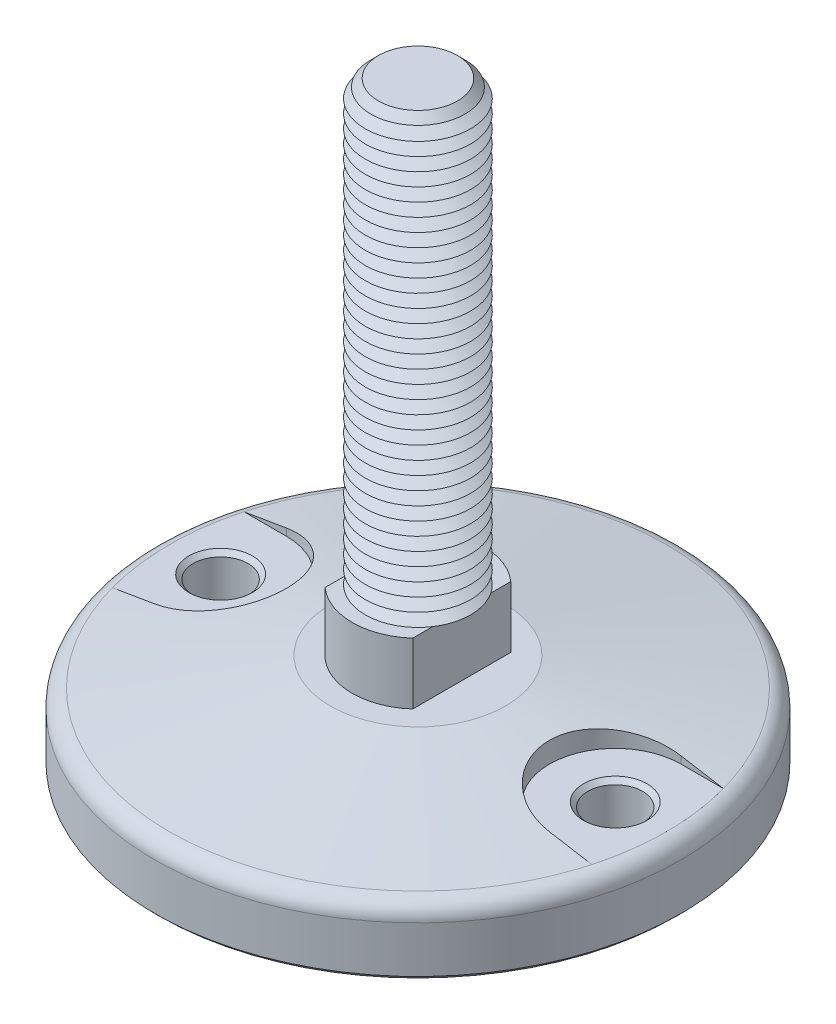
ISO-10303-21;
HEADER;
FILE_DESCRIPTION(('STEP AP214'),'2;1');
FILE_NAME('part.step','',(''),(''),'','','');
FILE_SCHEMA(('AUTOMOTIVE_DESIGN { 1 0 10303 214 1 1 1 1 }'));
ENDSEC;
DATA;
#1=APPLICATION_CONTEXT('core data for automotive mechanical design processes');
#2=APPLICATION_PROTOCOL_DEFINITION('international standard','automotive_design',2000,#1);
#3=PRODUCT_CONTEXT('',#1,'mechanical');
#4=PRODUCT('Part','Part','',(#3));
#5=PRODUCT_RELATED_PRODUCT_CATEGORY('part','',(#4));
#6=PRODUCT_DEFINITION_FORMATION('','',#4);
#7=PRODUCT_DEFINITION_CONTEXT('part definition',#1,'design');
#8=PRODUCT_DEFINITION('design','',#6,#7);
#9=PRODUCT_DEFINITION_SHAPE('','',#8);
#10=(LENGTH_UNIT() NAMED_UNIT(*) SI_UNIT(.MILLI.,.METRE.));
#11=(NAMED_UNIT(*) PLANE_ANGLE_UNIT() SI_UNIT($,.RADIAN.));
#12=(NAMED_UNIT(*) SI_UNIT($,.STERADIAN.) SOLID_ANGLE_UNIT());
#13=UNCERTAINTY_MEASURE_WITH_UNIT(LENGTH_MEASURE(1.E-05),#10,'distance_accuracy_value','');
#14=(GEOMETRIC_REPRESENTATION_CONTEXT(3) GLOBAL_UNCERTAINTY_ASSIGNED_CONTEXT((#13)) GLOBAL_UNIT_ASSIGNED_CONTEXT((#10,
#11,#12)) REPRESENTATION_CONTEXT('',''));
#15=CARTESIAN_POINT('',(0.,0.,0.));
#16=DIRECTION('',(0.,0.,1.));
#17=DIRECTION('',(1.,0.,0.));
#18=AXIS2_PLACEMENT_3D('',#15,#16,#17);
#19=CARTESIAN_POINT('',(0.,0.,0.));
#20=DIRECTION('',(0.,-1.,0.));
#21=DIRECTION('',(0.,0.,-1.));
#22=AXIS2_PLACEMENT_3D('',#19,#20,#21);
#23=CONICAL_SURFACE('',#22,20.,1.39626340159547);
#24=CARTESIAN_POINT('',(-45.0002,-4.83741692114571,14.9999999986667));
#25=CARTESIAN_POINT('',(-44.5716630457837,-4.76573974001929,15.00004953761));
#26=CARTESIAN_POINT('',(-44.1432899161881,-4.69315382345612,14.9816490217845));
#27=CARTESIAN_POINT('',(-43.2899455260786,-4.54659214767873,14.9083446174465));
#28=CARTESIAN_POINT('',(-42.8649740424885,-4.47261648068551,14.8534431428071));
#29=CARTESIAN_POINT('',(-42.0217138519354,-4.32373997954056,14.7075791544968));
#30=CARTESIAN_POINT('',(-41.6034211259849,-4.24883975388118,14.6166392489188));
#31=CARTESIAN_POINT('',(-40.7762181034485,-4.09853953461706,14.3993925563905));
#32=CARTESIAN_POINT('',(-40.367307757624,-4.02313954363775,14.2730859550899));
#33=CARTESIAN_POINT('',(-39.5616137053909,-3.87232244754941,13.9859546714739));
#34=CARTESIAN_POINT('',(-39.1648346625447,-3.79690534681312,13.82511690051));
#35=CARTESIAN_POINT('',(-38.3863815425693,-3.64664451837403,13.4700801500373));
#36=CARTESIAN_POINT('',(-38.0047074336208,-3.57180078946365,13.2758812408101));
#37=CARTESIAN_POINT('',(-37.259234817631,-3.42331263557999,12.8554907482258));
#38=CARTESIAN_POINT('',(-36.8954336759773,-3.3496680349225,12.6293038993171));
#39=CARTESIAN_POINT('',(-36.188253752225,-3.20423999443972,12.1464578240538));
#40=CARTESIAN_POINT('',(-35.8448748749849,-3.13245654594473,11.8897987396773));
#41=CARTESIAN_POINT('',(-35.1811599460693,-2.99151324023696,11.347857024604));
#42=CARTESIAN_POINT('',(-34.8608145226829,-2.92235232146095,11.0625861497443));
#43=CARTESIAN_POINT('',(-34.2453649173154,-2.78741726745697,10.4652623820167));
#44=CARTESIAN_POINT('',(-33.9502608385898,-2.72164314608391,10.1532093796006));
#45=CARTESIAN_POINT('',(-33.3874760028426,-2.59432642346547,9.50440564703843));
#46=CARTESIAN_POINT('',(-33.1197986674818,-2.53278435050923,9.1676518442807));
#47=CARTESIAN_POINT('',(-32.6139762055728,-2.41484175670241,8.47180160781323));
#48=CARTESIAN_POINT('',(-32.3758306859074,-2.35844116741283,8.11270547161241));
#49=CARTESIAN_POINT('',(-31.9339537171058,-2.25242768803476,7.3796428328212));
#50=CARTESIAN_POINT('',(-31.7298031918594,-2.20273384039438,7.00594067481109));
#51=CARTESIAN_POINT('',(-31.3537289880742,-2.11014777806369,6.24184253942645));
#52=CARTESIAN_POINT('',(-31.1818051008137,-2.0672555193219,5.851446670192));
#53=CARTESIAN_POINT('',(-30.8716543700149,-1.98913642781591,5.05684707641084));
#54=CARTESIAN_POINT('',(-30.7334198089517,-1.95390783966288,4.65264653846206));
#55=CARTESIAN_POINT('',(-30.4917961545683,-1.89187314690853,3.8333303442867));
#56=CARTESIAN_POINT('',(-30.3884062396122,-1.86506684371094,3.41821494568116));
#57=CARTESIAN_POINT('',(-30.2197121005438,-1.82110989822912,2.59156261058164));
#58=CARTESIAN_POINT('',(-30.1534519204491,-1.80371733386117,2.18023342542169));
#59=CARTESIAN_POINT('',(-30.0553621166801,-1.77790819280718,1.35321233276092));
#60=CARTESIAN_POINT('',(-30.0235318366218,-1.76949144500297,0.937520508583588));
#61=CARTESIAN_POINT('',(-29.9945838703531,-1.76183851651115,0.104887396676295));
#62=CARTESIAN_POINT('',(-29.9974627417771,-1.76260142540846,-0.31205376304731));
#63=CARTESIAN_POINT('',(-30.0378993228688,-1.7732869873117,-1.14413077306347));
#64=CARTESIAN_POINT('',(-30.0754567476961,-1.7832095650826,-1.55926663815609));
#65=CARTESIAN_POINT('',(-30.1838290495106,-1.81168784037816,-2.37646539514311));
#66=CARTESIAN_POINT('',(-30.253968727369,-1.83006819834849,-2.77862418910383));
#67=CARTESIAN_POINT('',(-30.4266561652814,-1.87498416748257,-3.57544878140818));
#68=CARTESIAN_POINT('',(-30.5292034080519,-1.90151964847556,-3.97011469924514));
#69=CARTESIAN_POINT('',(-30.7658801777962,-1.96218463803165,-4.74927597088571));
#70=CARTESIAN_POINT('',(-30.9000112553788,-1.99631451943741,-5.13377082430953));
#71=CARTESIAN_POINT('',(-31.1988010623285,-2.0714948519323,-5.8900091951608));
#72=CARTESIAN_POINT('',(-31.3634602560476,-2.11254540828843,-6.26175251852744));
#73=CARTESIAN_POINT('',(-31.7241833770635,-2.20134838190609,-6.99438182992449));
#74=CARTESIAN_POINT('',(-31.9205960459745,-2.24917439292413,-7.35508715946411));
#75=CARTESIAN_POINT('',(-32.3419301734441,-2.35035157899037,-8.0586224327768));
#76=CARTESIAN_POINT('',(-32.5668517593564,-2.40370277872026,-8.40145229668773));
#77=CARTESIAN_POINT('',(-33.0435892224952,-2.51513098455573,-9.06707399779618));
#78=CARTESIAN_POINT('',(-33.2954062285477,-2.57320818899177,-9.38986499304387));
#79=CARTESIAN_POINT('',(-33.8241636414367,-2.69330733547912,-10.0133800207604));
#80=CARTESIAN_POINT('',(-34.1011044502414,-2.7553293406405,-10.314103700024));
#81=CARTESIAN_POINT('',(-34.6862220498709,-2.88434050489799,-10.8996326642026));
#82=CARTESIAN_POINT('',(-34.9950517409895,-2.95141968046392,-11.1837659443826));
#83=CARTESIAN_POINT('',(-35.6350756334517,-3.08820736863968,-11.7249231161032));
#84=CARTESIAN_POINT('',(-35.9662703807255,-3.15791594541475,-11.981946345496));
#85=CARTESIAN_POINT('',(-36.6488620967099,-3.29929251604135,-12.4673150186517));
#86=CARTESIAN_POINT('',(-37.0002673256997,-3.37096130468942,-12.695648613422));
#87=CARTESIAN_POINT('',(-37.7207317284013,-3.51558573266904,-13.1220222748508));
#88=CARTESIAN_POINT('',(-38.0897905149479,-3.58854134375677,-13.3200630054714));
#89=CARTESIAN_POINT('',(-38.8503500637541,-3.73657205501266,-13.6880864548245));
#90=CARTESIAN_POINT('',(-39.2421468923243,-3.81166085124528,-13.8574521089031));
#91=CARTESIAN_POINT('',(-40.0387180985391,-3.9619955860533,-14.1621864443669));
#92=CARTESIAN_POINT('',(-40.4434925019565,-4.03724152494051,-14.2975550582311));
#93=CARTESIAN_POINT('',(-41.2626403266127,-4.18727395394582,-14.5331883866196));
#94=CARTESIAN_POINT('',(-41.6770011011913,-4.26206090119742,-14.6334968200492));
#95=CARTESIAN_POINT('',(-42.5127363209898,-4.41076799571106,-14.7984730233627));
#96=CARTESIAN_POINT('',(-42.9341072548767,-4.48468854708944,-14.86315811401));
#97=CARTESIAN_POINT('',(-43.6303300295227,-4.60517722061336,-14.9398587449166));
#98=CARTESIAN_POINT('',(-43.9039978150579,-4.65212396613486,-14.9624242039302));
#99=CARTESIAN_POINT('',(-44.4518138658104,-4.74530664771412,-14.992485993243));
#100=CARTESIAN_POINT('',(-44.725960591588,-4.79154362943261,-15.0000071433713));
#101=CARTESIAN_POINT('',(-45.0002,-4.83741692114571,-14.9999999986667));
#102=B_SPLINE_CURVE_WITH_KNOTS('',3,(#24,#25,#26,#27,#28,#29,#30,#31,#32,#33,#34,#35,#36,#37,
#38,#39,#40,#41,#42,#43,#44,#45,#46,#47,#48,#49,#50,#51,#52,#53,#54,#55,#56,#57,#58,#59,#60,#61,
#62,#63,#64,#65,#66,#67,#68,#69,#70,#71,#72,#73,#74,#75,#76,#77,#78,#79,#80,#81,#82,#83,#84,#85,
#86,#87,#88,#89,#90,#91,#92,#93,#94,#95,#96,#97,#98,#99,#100,#101),.UNSPECIFIED.,.F.,.F.,(4,2,2,
2,2,2,2,2,2,2,2,2,2,2,2,2,2,2,2,2,2,2,2,2,2,2,2,2,2,2,2,2,2,2,2,2,2,2,4),(0.,1.30306238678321,
2.60603860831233,3.9081987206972,5.21035199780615,6.51299971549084,7.81564468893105,
9.11809706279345,10.4205433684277,11.7224567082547,13.0243753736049,14.3264562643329,
15.6285198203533,16.9131037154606,18.1976792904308,19.4819603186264,20.7662110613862,
22.0156679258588,23.2651009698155,24.514410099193,25.7637089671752,26.9882006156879,
28.212672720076,29.4372049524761,30.6617558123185,31.9008050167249,33.1398597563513,
34.3789665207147,35.6180931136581,36.8915557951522,38.1650495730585,39.4390675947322,
40.7130576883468,42.0116991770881,43.3103432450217,44.6073621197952,45.9037498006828,
46.7391139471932,47.5730987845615),.UNSPECIFIED.);
#103=CARTESIAN_POINT('',(-45.,-4.8373834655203,15.));
#104=VERTEX_POINT('',#103);
#105=CARTESIAN_POINT('',(-45.,-4.8373834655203,-15.));
#106=VERTEX_POINT('',#105);
#107=EDGE_CURVE('E543',#104,#106,#102,.T.);
#108=ORIENTED_EDGE('',*,*,#107,.F.);
#109=CARTESIAN_POINT('',(-75.3836954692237,-10.0262296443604,15.));
#110=CARTESIAN_POINT('',(-73.5381209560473,-9.70707583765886,15.));
#111=CARTESIAN_POINT('',(-71.6924756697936,-9.3883303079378,15.));
#112=CARTESIAN_POINT('',(-68.000998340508,-8.75192554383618,15.));
#113=CARTESIAN_POINT('',(-66.1551662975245,-8.43426630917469,15.));
#114=CARTESIAN_POINT('',(-62.4632858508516,-7.80030655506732,15.));
#115=CARTESIAN_POINT('',(-60.6172374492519,-7.484006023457,15.));
#116=CARTESIAN_POINT('',(-56.9248399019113,-6.85315810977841,15.));
#117=CARTESIAN_POINT('',(-55.078490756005,-6.53861072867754,15.));
#118=CARTESIAN_POINT('',(-51.3853818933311,-5.91182468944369,15.));
#119=CARTESIAN_POINT('',(-49.538622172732,-5.59958605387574,15.));
#120=CARTESIAN_POINT('',(-45.8445795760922,-4.97822990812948,15.));
#121=CARTESIAN_POINT('',(-43.9972967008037,-4.66911239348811,15.));
#122=CARTESIAN_POINT('',(-41.2258181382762,-4.20871611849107,15.));
#123=CARTESIAN_POINT('',(-40.3018950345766,-4.05579661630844,15.));
#124=CARTESIAN_POINT('',(-38.4538315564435,-3.75127801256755,15.));
#125=CARTESIAN_POINT('',(-37.5296911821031,-3.59967891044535,15.));
#126=CARTESIAN_POINT('',(-35.6811466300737,-3.29806807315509,15.));
#127=CARTESIAN_POINT('',(-34.7567424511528,-3.14805634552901,15.));
#128=CARTESIAN_POINT('',(-32.9076160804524,-2.84999796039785,15.));
#129=CARTESIAN_POINT('',(-31.9828938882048,-2.70195130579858,15.));
#130=CARTESIAN_POINT('',(-31.05798475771,-2.55507589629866,15.));
#131=B_SPLINE_CURVE_WITH_KNOTS('',3,(#109,#110,#111,#112,#113,#114,#115,#116,#117,#118,#119,
#120,#121,#122,#123,#124,#125,#126,#127,#128,#129,#130),.UNSPECIFIED.,.F.,.F.,(4,2,2,2,2,2,2,2,
2,2,4),(0.,5.6189004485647,11.2377994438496,16.8566480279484,22.4754997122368,28.0944062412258,
33.7133047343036,36.5227815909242,39.3322572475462,42.1417462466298,44.9512393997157),.UNSPECIFIED.);
#132=CARTESIAN_POINT('',(-54.6728284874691,-6.47,15.));
#133=VERTEX_POINT('',#132);
#134=EDGE_CURVE('E517',#133,#104,#131,.T.);
#135=ORIENTED_EDGE('',*,*,#134,.F.);
#136=CARTESIAN_POINT('',(0.,-6.47,0.));
#137=DIRECTION('',(0.,1.,0.));
#138=DIRECTION('',(0.,0.,1.));
#139=AXIS2_PLACEMENT_3D('',#136,#137,#138);
#140=CIRCLE('',#139,56.693193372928);
#141=CARTESIAN_POINT('',(-54.6728284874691,-6.47,-15.));
#142=VERTEX_POINT('',#141);
#143=EDGE_CURVE('E501',#133,#142,#140,.F.);
#144=ORIENTED_EDGE('',*,*,#143,.T.);
#145=CARTESIAN_POINT('',(-31.05798475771,-2.55507589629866,-15.));
#146=CARTESIAN_POINT('',(-31.9828938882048,-2.70195130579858,-15.));
#147=CARTESIAN_POINT('',(-32.9076160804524,-2.84999796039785,-15.));
#148=CARTESIAN_POINT('',(-34.7567424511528,-3.14805634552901,-15.));
#149=CARTESIAN_POINT('',(-35.6811466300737,-3.29806807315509,-15.));
#150=CARTESIAN_POINT('',(-37.5296911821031,-3.59967891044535,-15.));
#151=CARTESIAN_POINT('',(-38.4538315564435,-3.75127801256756,-15.));
#152=CARTESIAN_POINT('',(-40.3018950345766,-4.05579661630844,-15.));
#153=CARTESIAN_POINT('',(-41.2258181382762,-4.20871611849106,-15.));
#154=CARTESIAN_POINT('',(-43.9972967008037,-4.66911239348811,-15.));
#155=CARTESIAN_POINT('',(-45.8445795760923,-4.97822990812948,-15.));
#156=CARTESIAN_POINT('',(-49.538622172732,-5.59958605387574,-15.));
#157=CARTESIAN_POINT('',(-51.3853818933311,-5.91182468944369,-15.));
#158=CARTESIAN_POINT('',(-55.078490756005,-6.53861072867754,-15.));
#159=CARTESIAN_POINT('',(-56.9248399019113,-6.85315810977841,-15.));
#160=CARTESIAN_POINT('',(-60.6172374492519,-7.48400602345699,-15.));
#161=CARTESIAN_POINT('',(-62.4632858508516,-7.80030655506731,-15.));
#162=CARTESIAN_POINT('',(-66.1551662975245,-8.43426630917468,-15.));
#163=CARTESIAN_POINT('',(-68.000998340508,-8.75192554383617,-15.));
#164=CARTESIAN_POINT('',(-71.6924756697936,-9.3883303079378,-15.));
#165=CARTESIAN_POINT('',(-73.5381209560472,-9.70707583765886,-15.));
#166=CARTESIAN_POINT('',(-75.3836954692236,-10.0262296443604,-15.));
#167=B_SPLINE_CURVE_WITH_KNOTS('',3,(#145,#146,#147,#148,#149,#150,#151,#152,#153,#154,#155,
#156,#157,#158,#159,#160,#161,#162,#163,#164,#165,#166),.UNSPECIFIED.,.F.,.F.,(4,2,2,2,2,2,2,2,
2,2,4),(0.,2.80949315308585,5.61898215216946,8.42845780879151,11.2379346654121,16.8568331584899,
22.4757396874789,28.0945913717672,33.713439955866,39.3323389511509,44.9512393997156),.UNSPECIFIED.);
#168=EDGE_CURVE('E509',#106,#142,#167,.T.);
#169=ORIENTED_EDGE('',*,*,#168,.F.);
#170=EDGE_LOOP('',(#108,#135,#144,#169));
#171=FACE_BOUND('',#170,.T.);
#172=CARTESIAN_POINT('',(0.,-6.47024674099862,0.));
#173=DIRECTION('',(0.,1.,0.));
#174=DIRECTION('',(0.,0.,1.));
#175=AXIS2_PLACEMENT_3D('',#172,#173,#174);
#176=CIRCLE('',#175,56.6945927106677);
#177=CARTESIAN_POINT('',(0.,-6.47024674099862,56.6945927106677));
#178=VERTEX_POINT('',#177);
#179=EDGE_CURVE('E490',#178,#178,#176,.T.);
#180=ORIENTED_EDGE('',*,*,#179,.T.);
#181=EDGE_LOOP('',(#180));
#182=FACE_BOUND('',#181,.T.);
#183=CARTESIAN_POINT('',(0.,0.,0.));
#184=DIRECTION('',(0.,1.,0.));
#185=DIRECTION('',(0.,0.,1.));
#186=AXIS2_PLACEMENT_3D('',#183,#184,#185);
#187=CIRCLE('',#186,20.);
#188=CARTESIAN_POINT('',(0.,0.,20.));
#189=VERTEX_POINT('',#188);
#190=EDGE_CURVE('E486',#189,#189,#187,.T.);
#191=ORIENTED_EDGE('',*,*,#190,.F.);
#192=EDGE_LOOP('',(#191));
#193=FACE_BOUND('',#192,.T.);
#194=CARTESIAN_POINT('',(68.3349761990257,-8.80963289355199,15.));
#195=CARTESIAN_POINT('',(66.4891647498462,-8.49175738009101,15.));
#196=CARTESIAN_POINT('',(64.6432610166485,-8.17441571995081,15.));
#197=CARTESIAN_POINT('',(60.9512028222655,-7.54120691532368,15.));
#198=CARTESIAN_POINT('',(59.1050483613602,-7.22533976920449,15.));
#199=CARTESIAN_POINT('',(55.4124579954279,-6.59549283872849,15.));
#200=CARTESIAN_POINT('',(53.5660220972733,-6.28151301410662,15.));
#201=CARTESIAN_POINT('',(49.8727228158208,-5.65605601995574,15.));
#202=CARTESIAN_POINT('',(48.0258594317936,-5.34457885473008,15.));
#203=CARTESIAN_POINT('',(44.3315117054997,-4.72503003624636,15.));
#204=CARTESIAN_POINT('',(42.4840273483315,-4.41695847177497,15.));
#205=CARTESIAN_POINT('',(38.7882718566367,-3.80560595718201,15.));
#206=CARTESIAN_POINT('',(36.9400007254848,-3.50232498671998,15.));
#207=CARTESIAN_POINT('',(34.1667136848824,-3.0526868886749,15.));
#208=CARTESIAN_POINT('',(33.2421265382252,-2.90368627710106,15.));
#209=CARTESIAN_POINT('',(31.3926029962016,-2.60787530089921,15.));
#210=CARTESIAN_POINT('',(30.4676666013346,-2.46106493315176,15.));
#211=CARTESIAN_POINT('',(28.617354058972,-2.17014916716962,15.));
#212=CARTESIAN_POINT('',(27.6919779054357,-2.02604380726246,15.));
#213=CARTESIAN_POINT('',(25.8406879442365,-1.74130150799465,15.));
#214=CARTESIAN_POINT('',(24.9147741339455,-1.60066458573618,15.));
#215=CARTESIAN_POINT('',(23.9885405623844,-1.46214325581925,15.));
#216=B_SPLINE_CURVE_WITH_KNOTS('',3,(#194,#195,#196,#197,#198,#199,#200,#201,#202,#203,#204,
#205,#206,#207,#208,#209,#210,#211,#212,#213,#214,#215),.UNSPECIFIED.,.F.,.F.,(4,2,2,2,2,2,2,2,
2,2,4),(0.,5.61894898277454,11.2378917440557,16.856714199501,22.4755463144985,28.0945245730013,
33.7134789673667,36.5230254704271,39.3325679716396,42.1421502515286,44.9517463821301),.UNSPECIFIED.);
#217=CARTESIAN_POINT('',(54.6728284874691,-6.47,15.));
#218=VERTEX_POINT('',#217);
#219=CARTESIAN_POINT('',(45.,-4.8373834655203,15.));
#220=VERTEX_POINT('',#219);
#221=EDGE_CURVE('E133',#218,#220,#216,.T.);
#222=ORIENTED_EDGE('',*,*,#221,.T.);
#223=CARTESIAN_POINT('',(45.0002,-4.83741692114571,14.9999999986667));
#224=CARTESIAN_POINT('',(44.5716630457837,-4.76573974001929,15.00004953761));
#225=CARTESIAN_POINT('',(44.1432899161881,-4.69315382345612,14.9816490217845));
#226=CARTESIAN_POINT('',(43.2899455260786,-4.54659214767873,14.9083446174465));
#227=CARTESIAN_POINT('',(42.8649740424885,-4.47261648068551,14.8534431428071));
#228=CARTESIAN_POINT('',(42.0217138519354,-4.32373997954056,14.7075791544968));
#229=CARTESIAN_POINT('',(41.6034211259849,-4.24883975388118,14.6166392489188));
#230=CARTESIAN_POINT('',(40.7762181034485,-4.09853953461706,14.3993925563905));
#231=CARTESIAN_POINT('',(40.367307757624,-4.02313954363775,14.2730859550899));
#232=CARTESIAN_POINT('',(39.5616137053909,-3.87232244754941,13.9859546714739));
#233=CARTESIAN_POINT('',(39.1648346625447,-3.79690534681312,13.82511690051));
#234=CARTESIAN_POINT('',(38.3863815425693,-3.64664451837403,13.4700801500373));
#235=CARTESIAN_POINT('',(38.0047074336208,-3.57180078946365,13.2758812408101));
#236=CARTESIAN_POINT('',(37.259234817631,-3.42331263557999,12.8554907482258));
#237=CARTESIAN_POINT('',(36.8954336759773,-3.3496680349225,12.6293038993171));
#238=CARTESIAN_POINT('',(36.188253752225,-3.20423999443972,12.1464578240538));
#239=CARTESIAN_POINT('',(35.8448748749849,-3.13245654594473,11.8897987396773));
#240=CARTESIAN_POINT('',(35.1811599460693,-2.99151324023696,11.347857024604));
#241=CARTESIAN_POINT('',(34.8608145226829,-2.92235232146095,11.0625861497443));
#242=CARTESIAN_POINT('',(34.2453649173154,-2.78741726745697,10.4652623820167));
#243=CARTESIAN_POINT('',(33.9502608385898,-2.72164314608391,10.1532093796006));
#244=CARTESIAN_POINT('',(33.3874760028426,-2.59432642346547,9.50440564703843));
#245=CARTESIAN_POINT('',(33.1197986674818,-2.53278435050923,9.1676518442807));
#246=CARTESIAN_POINT('',(32.6139762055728,-2.41484175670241,8.47180160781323));
#247=CARTESIAN_POINT('',(32.3758306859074,-2.35844116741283,8.11270547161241));
#248=CARTESIAN_POINT('',(31.9339537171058,-2.25242768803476,7.3796428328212));
#249=CARTESIAN_POINT('',(31.7298031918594,-2.20273384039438,7.00594067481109));
#250=CARTESIAN_POINT('',(31.3537289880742,-2.11014777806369,6.24184253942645));
#251=CARTESIAN_POINT('',(31.1818051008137,-2.0672555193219,5.851446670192));
#252=CARTESIAN_POINT('',(30.8716543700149,-1.98913642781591,5.05684707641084));
#253=CARTESIAN_POINT('',(30.7334198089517,-1.95390783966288,4.65264653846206));
#254=CARTESIAN_POINT('',(30.4917961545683,-1.89187314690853,3.8333303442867));
#255=CARTESIAN_POINT('',(30.3884062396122,-1.86506684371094,3.41821494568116));
#256=CARTESIAN_POINT('',(30.2197121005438,-1.82110989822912,2.59156261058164));
#257=CARTESIAN_POINT('',(30.1534519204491,-1.80371733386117,2.18023342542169));
#258=CARTESIAN_POINT('',(30.0553621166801,-1.77790819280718,1.35321233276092));
#259=CARTESIAN_POINT('',(30.0235318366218,-1.76949144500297,0.937520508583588));
#260=CARTESIAN_POINT('',(29.9945838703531,-1.76183851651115,0.104887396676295));
#261=CARTESIAN_POINT('',(29.9974627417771,-1.76260142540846,-0.31205376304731));
#262=CARTESIAN_POINT('',(30.0378993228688,-1.7732869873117,-1.14413077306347));
#263=CARTESIAN_POINT('',(30.0754567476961,-1.7832095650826,-1.55926663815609));
#264=CARTESIAN_POINT('',(30.1838290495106,-1.81168784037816,-2.37646539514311));
#265=CARTESIAN_POINT('',(30.253968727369,-1.83006819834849,-2.77862418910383));
#266=CARTESIAN_POINT('',(30.4266561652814,-1.87498416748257,-3.57544878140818));
#267=CARTESIAN_POINT('',(30.5292034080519,-1.90151964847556,-3.97011469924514));
#268=CARTESIAN_POINT('',(30.7658801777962,-1.96218463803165,-4.74927597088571));
#269=CARTESIAN_POINT('',(30.9000112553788,-1.99631451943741,-5.13377082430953));
#270=CARTESIAN_POINT('',(31.1988010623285,-2.0714948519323,-5.8900091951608));
#271=CARTESIAN_POINT('',(31.3634602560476,-2.11254540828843,-6.26175251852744));
#272=CARTESIAN_POINT('',(31.7241833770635,-2.20134838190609,-6.99438182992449));
#273=CARTESIAN_POINT('',(31.9205960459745,-2.24917439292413,-7.35508715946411));
#274=CARTESIAN_POINT('',(32.3419301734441,-2.35035157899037,-8.0586224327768));
#275=CARTESIAN_POINT('',(32.5668517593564,-2.40370277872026,-8.40145229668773));
#276=CARTESIAN_POINT('',(33.0435892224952,-2.51513098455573,-9.06707399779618));
#277=CARTESIAN_POINT('',(33.2954062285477,-2.57320818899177,-9.38986499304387));
#278=CARTESIAN_POINT('',(33.8241636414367,-2.69330733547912,-10.0133800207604));
#279=CARTESIAN_POINT('',(34.1011044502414,-2.7553293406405,-10.314103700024));
#280=CARTESIAN_POINT('',(34.6862220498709,-2.88434050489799,-10.8996326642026));
#281=CARTESIAN_POINT('',(34.9950517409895,-2.95141968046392,-11.1837659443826));
#282=CARTESIAN_POINT('',(35.6350756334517,-3.08820736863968,-11.7249231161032));
#283=CARTESIAN_POINT('',(35.9662703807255,-3.15791594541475,-11.981946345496));
#284=CARTESIAN_POINT('',(36.6488620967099,-3.29929251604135,-12.4673150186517));
#285=CARTESIAN_POINT('',(37.0002673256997,-3.37096130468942,-12.695648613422));
#286=CARTESIAN_POINT('',(37.7207317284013,-3.51558573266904,-13.1220222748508));
#287=CARTESIAN_POINT('',(38.0897905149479,-3.58854134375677,-13.3200630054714));
#288=CARTESIAN_POINT('',(38.8503500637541,-3.73657205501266,-13.6880864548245));
#289=CARTESIAN_POINT('',(39.2421468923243,-3.81166085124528,-13.8574521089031));
#290=CARTESIAN_POINT('',(40.0387180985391,-3.9619955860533,-14.1621864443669));
#291=CARTESIAN_POINT('',(40.4434925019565,-4.03724152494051,-14.2975550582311));
#292=CARTESIAN_POINT('',(41.2626403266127,-4.18727395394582,-14.5331883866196));
#293=CARTESIAN_POINT('',(41.6770011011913,-4.26206090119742,-14.6334968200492));
#294=CARTESIAN_POINT('',(42.5127363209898,-4.41076799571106,-14.7984730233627));
#295=CARTESIAN_POINT('',(42.9341072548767,-4.48468854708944,-14.86315811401));
#296=CARTESIAN_POINT('',(43.6303300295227,-4.60517722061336,-14.9398587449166));
#297=CARTESIAN_POINT('',(43.9039978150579,-4.65212396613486,-14.9624242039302));
#298=CARTESIAN_POINT('',(44.4518138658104,-4.74530664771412,-14.992485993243));
#299=CARTESIAN_POINT('',(44.725960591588,-4.79154362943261,-15.0000071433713));
#300=CARTESIAN_POINT('',(45.0002,-4.83741692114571,-14.9999999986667));
#301=B_SPLINE_CURVE_WITH_KNOTS('',3,(#223,#224,#225,#226,#227,#228,#229,#230,#231,#232,#233,
#234,#235,#236,#237,#238,#239,#240,#241,#242,#243,#244,#245,#246,#247,#248,#249,#250,#251,#252,
#253,#254,#255,#256,#257,#258,#259,#260,#261,#262,#263,#264,#265,#266,#267,#268,#269,#270,#271,
#272,#273,#274,#275,#276,#277,#278,#279,#280,#281,#282,#283,#284,#285,#286,#287,#288,#289,#290,
#291,#292,#293,#294,#295,#296,#297,#298,#299,#300),.UNSPECIFIED.,.F.,.F.,(4,2,2,2,2,2,2,2,2,2,2,
2,2,2,2,2,2,2,2,2,2,2,2,2,2,2,2,2,2,2,2,2,2,2,2,2,2,2,4),(0.,1.30306238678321,2.60603860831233,
3.9081987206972,5.21035199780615,6.51299971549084,7.81564468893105,9.11809706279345,
10.4205433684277,11.7224567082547,13.0243753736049,14.3264562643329,15.6285198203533,
16.9131037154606,18.1976792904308,19.4819603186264,20.7662110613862,22.0156679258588,
23.2651009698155,24.514410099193,25.7637089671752,26.9882006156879,28.212672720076,
29.4372049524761,30.6617558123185,31.9008050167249,33.1398597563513,34.3789665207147,
35.6180931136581,36.8915557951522,38.1650495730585,39.4390675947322,40.7130576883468,
42.0116991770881,43.3103432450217,44.6073621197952,45.9037498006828,46.7391139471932,
47.5730987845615),.UNSPECIFIED.);
#302=CARTESIAN_POINT('',(45.,-4.8373834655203,-15.));
#303=VERTEX_POINT('',#302);
#304=EDGE_CURVE('E145',#220,#303,#301,.T.);
#305=ORIENTED_EDGE('',*,*,#304,.T.);
#306=CARTESIAN_POINT('',(23.9885405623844,-1.46214325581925,-15.));
#307=CARTESIAN_POINT('',(24.9147741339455,-1.60066458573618,-15.));
#308=CARTESIAN_POINT('',(25.8406879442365,-1.74130150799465,-15.));
#309=CARTESIAN_POINT('',(27.6919779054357,-2.02604380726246,-15.));
#310=CARTESIAN_POINT('',(28.617354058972,-2.17014916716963,-15.));
#311=CARTESIAN_POINT('',(30.4676666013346,-2.46106493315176,-15.));
#312=CARTESIAN_POINT('',(31.3926029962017,-2.60787530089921,-15.));
#313=CARTESIAN_POINT('',(33.2421265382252,-2.90368627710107,-15.));
#314=CARTESIAN_POINT('',(34.1667136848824,-3.0526868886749,-15.));
#315=CARTESIAN_POINT('',(36.9400007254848,-3.50232498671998,-15.));
#316=CARTESIAN_POINT('',(38.7882718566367,-3.80560595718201,-15.));
#317=CARTESIAN_POINT('',(42.4840273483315,-4.41695847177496,-15.));
#318=CARTESIAN_POINT('',(44.3315117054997,-4.72503003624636,-15.));
#319=CARTESIAN_POINT('',(48.0258594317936,-5.34457885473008,-15.));
#320=CARTESIAN_POINT('',(49.8727228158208,-5.65605601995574,-15.));
#321=CARTESIAN_POINT('',(53.5660220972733,-6.28151301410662,-15.));
#322=CARTESIAN_POINT('',(55.4124579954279,-6.59549283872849,-15.));
#323=CARTESIAN_POINT('',(59.1050483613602,-7.22533976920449,-15.));
#324=CARTESIAN_POINT('',(60.9512028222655,-7.54120691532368,-15.));
#325=CARTESIAN_POINT('',(64.6432610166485,-8.17441571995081,-15.));
#326=CARTESIAN_POINT('',(66.4891647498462,-8.49175738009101,-15.));
#327=CARTESIAN_POINT('',(68.3349761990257,-8.80963289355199,-15.));
#328=B_SPLINE_CURVE_WITH_KNOTS('',3,(#306,#307,#308,#309,#310,#311,#312,#313,#314,#315,#316,
#317,#318,#319,#320,#321,#322,#323,#324,#325,#326,#327),.UNSPECIFIED.,.F.,.F.,(4,2,2,2,2,2,2,2,
2,2,4),(0.,2.80959613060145,5.61917841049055,8.42872091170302,11.2382674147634,16.8572218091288,
22.4762000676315,28.0950321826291,33.7138546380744,39.3327973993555,44.9517463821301),.UNSPECIFIED.);
#329=CARTESIAN_POINT('',(54.6728284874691,-6.47,-15.));
#330=VERTEX_POINT('',#329);
#331=EDGE_CURVE('E574',#303,#330,#328,.T.);
#332=ORIENTED_EDGE('',*,*,#331,.T.);
#333=CARTESIAN_POINT('',(0.,-6.47,0.));
#334=DIRECTION('',(0.,1.,0.));
#335=DIRECTION('',(0.,0.,1.));
#336=AXIS2_PLACEMENT_3D('',#333,#334,#335);
#337=CIRCLE('',#336,56.693193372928);
#338=EDGE_CURVE('E565',#330,#218,#337,.F.);
#339=ORIENTED_EDGE('',*,*,#338,.T.);
#340=EDGE_LOOP('',(#222,#305,#332,#339));
#341=FACE_BOUND('',#340,.T.);
#342=ADVANCED_FACE('F39',(#171,#182,#193,#341),#23,.T.);
#343=CARTESIAN_POINT('',(0.,14.,0.));
#344=DIRECTION('',(0.,1.,0.));
#345=DIRECTION('',(0.,0.,1.));
#346=AXIS2_PLACEMENT_3D('',#343,#344,#345);
#347=PLANE('',#346);
#348=CARTESIAN_POINT('',(0.,14.,0.));
#349=DIRECTION('',(0.,1.,0.));
#350=DIRECTION('',(0.,0.,1.));
#351=AXIS2_PLACEMENT_3D('',#348,#349,#350);
#352=CIRCLE('',#351,12.);
#353=CARTESIAN_POINT('',(10.,14.,-6.6332495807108));
#354=VERTEX_POINT('',#353);
#355=CARTESIAN_POINT('',(-10.,14.,-6.6332495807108));
#356=VERTEX_POINT('',#355);
#357=EDGE_CURVE('E502',#354,#356,#352,.T.);
#358=ORIENTED_EDGE('',*,*,#357,.F.);
#359=DIRECTION('',(0.,0.,1.));
#360=VECTOR('',#359,1.);
#361=CARTESIAN_POINT('',(10.,14.,11.180339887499));
#362=LINE('',#361,#360);
#363=CARTESIAN_POINT('',(10.,14.,-11.1803398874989));
#364=VERTEX_POINT('',#363);
#365=EDGE_CURVE('E465',#364,#354,#362,.T.);
#366=ORIENTED_EDGE('',*,*,#365,.F.);
#367=CARTESIAN_POINT('',(0.,14.,0.));
#368=DIRECTION('',(0.,1.,0.));
#369=DIRECTION('',(0.,0.,1.));
#370=AXIS2_PLACEMENT_3D('',#367,#368,#369);
#371=CIRCLE('',#370,15.);
#372=CARTESIAN_POINT('',(-10.,14.,-11.180339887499));
#373=VERTEX_POINT('',#372);
#374=EDGE_CURVE('E479',#364,#373,#371,.T.);
#375=ORIENTED_EDGE('',*,*,#374,.T.);
#376=DIRECTION('',(0.,0.,-1.));
#377=VECTOR('',#376,1.);
#378=CARTESIAN_POINT('',(-10.,14.,-11.180339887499));
#379=LINE('',#378,#377);
#380=EDGE_CURVE('E452',#356,#373,#379,.T.);
#381=ORIENTED_EDGE('',*,*,#380,.F.);
#382=EDGE_LOOP('',(#358,#366,#375,#381));
#383=FACE_BOUND('',#382,.T.);
#384=ADVANCED_FACE('F627',(#383),#347,.T.);
#385=CARTESIAN_POINT('',(0.,14.,0.));
#386=DIRECTION('',(0.,-1.,0.));
#387=DIRECTION('',(0.,0.,-1.));
#388=AXIS2_PLACEMENT_3D('',#385,#386,#387);
#389=CYLINDRICAL_SURFACE('',#388,15.);
#390=CARTESIAN_POINT('',(-10.,14.,11.1803398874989));
#391=VERTEX_POINT('',#390);
#392=CARTESIAN_POINT('',(10.,14.,11.180339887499));
#393=VERTEX_POINT('',#392);
#394=EDGE_CURVE('E457',#391,#393,#371,.T.);
#395=ORIENTED_EDGE('',*,*,#394,.F.);
#396=DIRECTION('',(0.,1.,0.));
#397=VECTOR('',#396,1.);
#398=CARTESIAN_POINT('',(-10.,0.,11.180339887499));
#399=LINE('',#398,#397);
#400=CARTESIAN_POINT('',(-10.,0.,11.180339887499));
#401=VERTEX_POINT('',#400);
#402=EDGE_CURVE('E446',#401,#391,#399,.T.);
#403=ORIENTED_EDGE('',*,*,#402,.F.);
#404=CARTESIAN_POINT('',(0.,0.,0.));
#405=DIRECTION('',(0.,1.,0.));
#406=DIRECTION('',(0.,0.,1.));
#407=AXIS2_PLACEMENT_3D('',#404,#405,#406);
#408=CIRCLE('',#407,15.);
#409=CARTESIAN_POINT('',(10.,0.,11.180339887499));
#410=VERTEX_POINT('',#409);
#411=EDGE_CURVE('E480',#401,#410,#408,.T.);
#412=ORIENTED_EDGE('',*,*,#411,.T.);
#413=DIRECTION('',(0.,1.,0.));
#414=VECTOR('',#413,1.);
#415=CARTESIAN_POINT('',(10.,0.,11.180339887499));
#416=LINE('',#415,#414);
#417=EDGE_CURVE('E470',#410,#393,#416,.T.);
#418=ORIENTED_EDGE('',*,*,#417,.T.);
#419=EDGE_LOOP('',(#395,#403,#412,#418));
#420=FACE_BOUND('',#419,.T.);
#421=ADVANCED_FACE('F632',(#420),#389,.T.);
#422=CARTESIAN_POINT('',(0.,0.,0.));
#423=DIRECTION('',(0.,1.,0.));
#424=DIRECTION('',(0.,0.,1.));
#425=AXIS2_PLACEMENT_3D('',#422,#423,#424);
#426=PLANE('',#425);
#427=CARTESIAN_POINT('',(10.,0.,-11.180339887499));
#428=VERTEX_POINT('',#427);
#429=CARTESIAN_POINT('',(-10.,0.,-11.180339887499));
#430=VERTEX_POINT('',#429);
#431=EDGE_CURVE('E484',#428,#430,#408,.T.);
#432=ORIENTED_EDGE('',*,*,#431,.F.);
#433=DIRECTION('',(0.,0.,1.));
#434=VECTOR('',#433,1.);
#435=CARTESIAN_POINT('',(10.,0.,11.180339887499));
#436=LINE('',#435,#434);
#437=EDGE_CURVE('E460',#428,#410,#436,.T.);
#438=ORIENTED_EDGE('',*,*,#437,.T.);
#439=ORIENTED_EDGE('',*,*,#411,.F.);
#440=DIRECTION('',(0.,0.,-1.));
#441=VECTOR('',#440,1.);
#442=CARTESIAN_POINT('',(-10.,0.,-11.180339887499));
#443=LINE('',#442,#441);
#444=EDGE_CURVE('E442',#401,#430,#443,.T.);
#445=ORIENTED_EDGE('',*,*,#444,.T.);
#446=EDGE_LOOP('',(#432,#438,#439,#445));
#447=FACE_BOUND('',#446,.T.);
#448=ORIENTED_EDGE('',*,*,#190,.T.);
#449=EDGE_LOOP('',(#448));
#450=FACE_BOUND('',#449,.T.);
#451=ADVANCED_FACE('F658',(#447,#450),#426,.T.);
#452=CARTESIAN_POINT('',(0.,61.3388655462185,0.));
#453=DIRECTION('',(0.,1.,0.));
#454=DIRECTION('',(0.,0.,1.));
#455=AXIS2_PLACEMENT_3D('',#452,#453,#454);
#456=CYLINDRICAL_SURFACE('',#455,60.);
#457=CARTESIAN_POINT('',(0.,-21.,0.));
#458=DIRECTION('',(0.,-1.,0.));
#459=DIRECTION('',(0.,0.,-1.));
#460=AXIS2_PLACEMENT_3D('',#457,#458,#459);
#461=CIRCLE('',#460,60.);
#462=CARTESIAN_POINT('',(0.,-21.,-60.));
#463=VERTEX_POINT('',#462);
#464=EDGE_CURVE('E48',#463,#463,#461,.F.);
#465=ORIENTED_EDGE('',*,*,#464,.T.);
#466=EDGE_LOOP('',(#465));
#467=FACE_BOUND('',#466,.T.);
#468=CARTESIAN_POINT('',(0.,-10.4094777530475,0.));
#469=DIRECTION('',(0.,-1.,0.));
#470=DIRECTION('',(0.,0.,-1.));
#471=AXIS2_PLACEMENT_3D('',#468,#469,#470);
#472=CIRCLE('',#471,60.);
#473=CARTESIAN_POINT('',(0.,-10.4094777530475,-60.));
#474=VERTEX_POINT('',#473);
#475=EDGE_CURVE('E485',#474,#474,#472,.T.);
#476=ORIENTED_EDGE('',*,*,#475,.T.);
#477=EDGE_LOOP('',(#476));
#478=FACE_BOUND('',#477,.T.);
#479=ADVANCED_FACE('F614',(#467,#478),#456,.T.);
#480=CARTESIAN_POINT('',(0.,-22.,60.));
#481=DIRECTION('',(0.,-1.,0.));
#482=DIRECTION('',(0.,0.,-1.));
#483=AXIS2_PLACEMENT_3D('',#480,#481,#482);
#484=PLANE('',#483);
#485=CARTESIAN_POINT('',(0.,-22.,0.));
#486=DIRECTION('',(0.,-1.,0.));
#487=DIRECTION('',(0.,0.,-1.));
#488=AXIS2_PLACEMENT_3D('',#485,#486,#487);
#489=CIRCLE('',#488,59.);
#490=CARTESIAN_POINT('',(0.,-22.,-59.));
#491=VERTEX_POINT('',#490);
#492=EDGE_CURVE('E11',#491,#491,#489,.T.);
#493=ORIENTED_EDGE('',*,*,#492,.T.);
#494=EDGE_LOOP('',(#493));
#495=FACE_BOUND('',#494,.T.);
#496=CARTESIAN_POINT('',(45.,-22.,0.));
#497=DIRECTION('',(0.,-1.,0.));
#498=DIRECTION('',(0.,0.,-1.));
#499=AXIS2_PLACEMENT_3D('',#496,#497,#498);
#500=CIRCLE('',#499,7.25000000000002);
#501=CARTESIAN_POINT('',(45.,-22.,-7.25000000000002));
#502=VERTEX_POINT('',#501);
#503=EDGE_CURVE('E604',#502,#502,#500,.F.);
#504=ORIENTED_EDGE('',*,*,#503,.T.);
#505=EDGE_LOOP('',(#504));
#506=FACE_BOUND('',#505,.T.);
#507=CARTESIAN_POINT('',(-45.,-22.,0.));
#508=DIRECTION('',(0.,-1.,0.));
#509=DIRECTION('',(0.,0.,-1.));
#510=AXIS2_PLACEMENT_3D('',#507,#508,#509);
#511=CIRCLE('',#510,7.25000000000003);
#512=CARTESIAN_POINT('',(-45.,-22.,-7.25000000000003));
#513=VERTEX_POINT('',#512);
#514=EDGE_CURVE('E549',#513,#513,#511,.F.);
#515=ORIENTED_EDGE('',*,*,#514,.T.);
#516=EDGE_LOOP('',(#515));
#517=FACE_BOUND('',#516,.T.);
#518=ADVANCED_FACE('F759',(#495,#506,#517),#484,.T.);
#519=CARTESIAN_POINT('',(0.,-10.4094777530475,0.));
#520=DIRECTION('',(0.,-1.,0.));
#521=DIRECTION('',(0.,0.,-1.));
#522=AXIS2_PLACEMENT_3D('',#519,#520,#521);
#523=TOROIDAL_SURFACE('',#522,56.,4.);
#524=ORIENTED_EDGE('',*,*,#475,.F.);
#525=EDGE_LOOP('',(#524));
#526=FACE_BOUND('',#525,.T.);
#527=ORIENTED_EDGE('',*,*,#179,.F.);
#528=EDGE_LOOP('',(#527));
#529=FACE_BOUND('',#528,.T.);
#530=ADVANCED_FACE('F764',(#526,#529),#523,.T.);
#531=ORIENTED_EDGE('',*,*,#431,.T.);
#532=DIRECTION('',(0.,1.,0.));
#533=VECTOR('',#532,1.);
#534=CARTESIAN_POINT('',(-10.,0.,-11.180339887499));
#535=LINE('',#534,#533);
#536=EDGE_CURVE('E453',#430,#373,#535,.T.);
#537=ORIENTED_EDGE('',*,*,#536,.T.);
#538=ORIENTED_EDGE('',*,*,#374,.F.);
#539=DIRECTION('',(0.,1.,0.));
#540=VECTOR('',#539,1.);
#541=CARTESIAN_POINT('',(10.,0.,-11.180339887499));
#542=LINE('',#541,#540);
#543=EDGE_CURVE('E464',#428,#364,#542,.T.);
#544=ORIENTED_EDGE('',*,*,#543,.F.);
#545=EDGE_LOOP('',(#531,#537,#538,#544));
#546=FACE_BOUND('',#545,.T.);
#547=ADVANCED_FACE('F654',(#546),#389,.T.);
#548=CARTESIAN_POINT('',(-10.,14.,6.6332495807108));
#549=VERTEX_POINT('',#548);
#550=CARTESIAN_POINT('',(10.,14.,6.6332495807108));
#551=VERTEX_POINT('',#550);
#552=EDGE_CURVE('E441',#549,#551,#352,.T.);
#553=ORIENTED_EDGE('',*,*,#552,.F.);
#554=EDGE_CURVE('E447',#391,#549,#379,.T.);
#555=ORIENTED_EDGE('',*,*,#554,.F.);
#556=ORIENTED_EDGE('',*,*,#394,.T.);
#557=EDGE_CURVE('E440',#551,#393,#362,.T.);
#558=ORIENTED_EDGE('',*,*,#557,.F.);
#559=EDGE_LOOP('',(#553,#555,#556,#558));
#560=FACE_BOUND('',#559,.T.);
#561=ADVANCED_FACE('F635',(#560),#347,.T.);
#562=CARTESIAN_POINT('',(10.,0.,11.180339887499));
#563=DIRECTION('',(-1.,0.,0.));
#564=DIRECTION('',(0.,0.,1.));
#565=AXIS2_PLACEMENT_3D('',#562,#563,#564);
#566=PLANE('',#565);
#567=ORIENTED_EDGE('',*,*,#365,.T.);
#568=EDGE_CURVE('E469',#354,#551,#362,.T.);
#569=ORIENTED_EDGE('',*,*,#568,.T.);
#570=ORIENTED_EDGE('',*,*,#557,.T.);
#571=ORIENTED_EDGE('',*,*,#417,.F.);
#572=ORIENTED_EDGE('',*,*,#437,.F.);
#573=ORIENTED_EDGE('',*,*,#543,.T.);
#574=EDGE_LOOP('',(#567,#569,#570,#571,#572,#573));
#575=FACE_BOUND('',#574,.T.);
#576=ADVANCED_FACE('F686',(#575),#566,.F.);
#577=CARTESIAN_POINT('',(-10.,0.,-11.180339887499));
#578=DIRECTION('',(1.,0.,0.));
#579=DIRECTION('',(0.,0.,-1.));
#580=AXIS2_PLACEMENT_3D('',#577,#578,#579);
#581=PLANE('',#580);
#582=ORIENTED_EDGE('',*,*,#554,.T.);
#583=EDGE_CURVE('E451',#549,#356,#379,.T.);
#584=ORIENTED_EDGE('',*,*,#583,.T.);
#585=ORIENTED_EDGE('',*,*,#380,.T.);
#586=ORIENTED_EDGE('',*,*,#536,.F.);
#587=ORIENTED_EDGE('',*,*,#444,.F.);
#588=ORIENTED_EDGE('',*,*,#402,.T.);
#589=EDGE_LOOP('',(#582,#584,#585,#586,#587,#588));
#590=FACE_BOUND('',#589,.T.);
#591=ADVANCED_FACE('F663',(#590),#581,.F.);
#592=CARTESIAN_POINT('',(0.,14.,0.));
#593=DIRECTION('',(0.,1.,0.));
#594=DIRECTION('',(0.,0.,1.));
#595=AXIS2_PLACEMENT_3D('',#592,#593,#594);
#596=PLANE('',#595);
#597=ORIENTED_EDGE('',*,*,#583,.F.);
#598=EDGE_CURVE('E436',#356,#549,#352,.T.);
#599=ORIENTED_EDGE('',*,*,#598,.F.);
#600=EDGE_LOOP('',(#597,#599));
#601=FACE_BOUND('',#600,.T.);
#602=ADVANCED_FACE('F675',(#601),#596,.F.);
#603=ORIENTED_EDGE('',*,*,#568,.F.);
#604=EDGE_CURVE('E437',#551,#354,#352,.T.);
#605=ORIENTED_EDGE('',*,*,#604,.F.);
#606=EDGE_LOOP('',(#603,#605));
#607=FACE_BOUND('',#606,.T.);
#608=ADVANCED_FACE('F688',(#607),#596,.F.);
#609=CARTESIAN_POINT('',(0.,14.,0.));
#610=DIRECTION('',(0.,-1.,0.));
#611=DIRECTION('',(0.,0.,-1.));
#612=AXIS2_PLACEMENT_3D('',#609,#610,#611);
#613=CONICAL_SURFACE('',#612,12.,1.0471975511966);
#614=CARTESIAN_POINT('',(0.,15.5,0.));
#615=DIRECTION('',(0.,1.,0.));
#616=DIRECTION('',(0.,0.,1.));
#617=AXIS2_PLACEMENT_3D('',#614,#615,#616);
#618=CIRCLE('',#617,9.40192378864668);
#619=CARTESIAN_POINT('',(0.,15.5,9.40192378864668));
#620=VERTEX_POINT('',#619);
#621=EDGE_CURVE('E432',#620,#620,#618,.T.);
#622=ORIENTED_EDGE('',*,*,#621,.F.);
#623=EDGE_LOOP('',(#622));
#624=FACE_BOUND('',#623,.T.);
#625=ORIENTED_EDGE('',*,*,#604,.T.);
#626=ORIENTED_EDGE('',*,*,#357,.T.);
#627=ORIENTED_EDGE('',*,*,#598,.T.);
#628=ORIENTED_EDGE('',*,*,#552,.T.);
#629=EDGE_LOOP('',(#625,#626,#627,#628));
#630=FACE_BOUND('',#629,.T.);
#631=ADVANCED_FACE('F1463',(#624,#630),#613,.T.);
#632=CARTESIAN_POINT('',(0.,15.5,0.));
#633=DIRECTION('',(0.,1.,0.));
#634=DIRECTION('',(0.,0.,1.));
#635=AXIS2_PLACEMENT_3D('',#632,#633,#634);
#636=CONICAL_SURFACE('',#635,9.40192378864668,1.0471975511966);
#637=CARTESIAN_POINT('',(0.,17.,0.));
#638=DIRECTION('',(0.,1.,0.));
#639=DIRECTION('',(0.,0.,1.));
#640=AXIS2_PLACEMENT_3D('',#637,#638,#639);
#641=CIRCLE('',#640,12.);
#642=CARTESIAN_POINT('',(0.,17.,12.));
#643=VERTEX_POINT('',#642);
#644=EDGE_CURVE('E428',#643,#643,#641,.T.);
#645=ORIENTED_EDGE('',*,*,#644,.F.);
#646=EDGE_LOOP('',(#645));
#647=FACE_BOUND('',#646,.T.);
#648=ORIENTED_EDGE('',*,*,#621,.T.);
#649=EDGE_LOOP('',(#648));
#650=FACE_BOUND('',#649,.T.);
#651=ADVANCED_FACE('F1454',(#647,#650),#636,.T.);
#652=CARTESIAN_POINT('',(0.,17.,0.));
#653=DIRECTION('',(0.,-1.,0.));
#654=DIRECTION('',(0.,0.,-1.));
#655=AXIS2_PLACEMENT_3D('',#652,#653,#654);
#656=CONICAL_SURFACE('',#655,12.,1.0471975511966);
#657=CARTESIAN_POINT('',(0.,18.5,0.));
#658=DIRECTION('',(0.,1.,0.));
#659=DIRECTION('',(0.,0.,1.));
#660=AXIS2_PLACEMENT_3D('',#657,#658,#659);
#661=CIRCLE('',#660,9.40192378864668);
#662=CARTESIAN_POINT('',(0.,18.5,9.40192378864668));
#663=VERTEX_POINT('',#662);
#664=EDGE_CURVE('E424',#663,#663,#661,.T.);
#665=ORIENTED_EDGE('',*,*,#664,.F.);
#666=EDGE_LOOP('',(#665));
#667=FACE_BOUND('',#666,.T.);
#668=ORIENTED_EDGE('',*,*,#644,.T.);
#669=EDGE_LOOP('',(#668));
#670=FACE_BOUND('',#669,.T.);
#671=ADVANCED_FACE('F1445',(#667,#670),#656,.T.);
#672=CARTESIAN_POINT('',(0.,18.5,0.));
#673=DIRECTION('',(0.,1.,0.));
#674=DIRECTION('',(0.,0.,1.));
#675=AXIS2_PLACEMENT_3D('',#672,#673,#674);
#676=CONICAL_SURFACE('',#675,9.40192378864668,1.0471975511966);
#677=CARTESIAN_POINT('',(0.,20.,0.));
#678=DIRECTION('',(0.,1.,0.));
#679=DIRECTION('',(0.,0.,1.));
#680=AXIS2_PLACEMENT_3D('',#677,#678,#679);
#681=CIRCLE('',#680,12.);
#682=CARTESIAN_POINT('',(0.,20.,12.));
#683=VERTEX_POINT('',#682);
#684=EDGE_CURVE('E420',#683,#683,#681,.T.);
#685=ORIENTED_EDGE('',*,*,#684,.F.);
#686=EDGE_LOOP('',(#685));
#687=FACE_BOUND('',#686,.T.);
#688=ORIENTED_EDGE('',*,*,#664,.T.);
#689=EDGE_LOOP('',(#688));
#690=FACE_BOUND('',#689,.T.);
#691=ADVANCED_FACE('F1436',(#687,#690),#676,.T.);
#692=CARTESIAN_POINT('',(0.,20.,0.));
#693=DIRECTION('',(0.,-1.,0.));
#694=DIRECTION('',(0.,0.,-1.));
#695=AXIS2_PLACEMENT_3D('',#692,#693,#694);
#696=CONICAL_SURFACE('',#695,12.,1.0471975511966);
#697=CARTESIAN_POINT('',(0.,21.5,0.));
#698=DIRECTION('',(0.,1.,0.));
#699=DIRECTION('',(0.,0.,1.));
#700=AXIS2_PLACEMENT_3D('',#697,#698,#699);
#701=CIRCLE('',#700,9.40192378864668);
#702=CARTESIAN_POINT('',(0.,21.5,9.40192378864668));
#703=VERTEX_POINT('',#702);
#704=EDGE_CURVE('E416',#703,#703,#701,.T.);
#705=ORIENTED_EDGE('',*,*,#704,.F.);
#706=EDGE_LOOP('',(#705));
#707=FACE_BOUND('',#706,.T.);
#708=ORIENTED_EDGE('',*,*,#684,.T.);
#709=EDGE_LOOP('',(#708));
#710=FACE_BOUND('',#709,.T.);
#711=ADVANCED_FACE('F1427',(#707,#710),#696,.T.);
#712=CARTESIAN_POINT('',(0.,21.5,0.));
#713=DIRECTION('',(0.,1.,0.));
#714=DIRECTION('',(0.,0.,1.));
#715=AXIS2_PLACEMENT_3D('',#712,#713,#714);
#716=CONICAL_SURFACE('',#715,9.40192378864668,1.0471975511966);
#717=CARTESIAN_POINT('',(0.,23.,0.));
#718=DIRECTION('',(0.,1.,0.));
#719=DIRECTION('',(0.,0.,1.));
#720=AXIS2_PLACEMENT_3D('',#717,#718,#719);
#721=CIRCLE('',#720,12.);
#722=CARTESIAN_POINT('',(0.,23.,12.));
#723=VERTEX_POINT('',#722);
#724=EDGE_CURVE('E412',#723,#723,#721,.T.);
#725=ORIENTED_EDGE('',*,*,#724,.F.);
#726=EDGE_LOOP('',(#725));
#727=FACE_BOUND('',#726,.T.);
#728=ORIENTED_EDGE('',*,*,#704,.T.);
#729=EDGE_LOOP('',(#728));
#730=FACE_BOUND('',#729,.T.);
#731=ADVANCED_FACE('F1418',(#727,#730),#716,.T.);
#732=CARTESIAN_POINT('',(0.,23.,0.));
#733=DIRECTION('',(0.,-1.,0.));
#734=DIRECTION('',(0.,0.,-1.));
#735=AXIS2_PLACEMENT_3D('',#732,#733,#734);
#736=CONICAL_SURFACE('',#735,12.,1.0471975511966);
#737=CARTESIAN_POINT('',(0.,24.5,0.));
#738=DIRECTION('',(0.,1.,0.));
#739=DIRECTION('',(0.,0.,1.));
#740=AXIS2_PLACEMENT_3D('',#737,#738,#739);
#741=CIRCLE('',#740,9.40192378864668);
#742=CARTESIAN_POINT('',(0.,24.5,9.40192378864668));
#743=VERTEX_POINT('',#742);
#744=EDGE_CURVE('E408',#743,#743,#741,.T.);
#745=ORIENTED_EDGE('',*,*,#744,.F.);
#746=EDGE_LOOP('',(#745));
#747=FACE_BOUND('',#746,.T.);
#748=ORIENTED_EDGE('',*,*,#724,.T.);
#749=EDGE_LOOP('',(#748));
#750=FACE_BOUND('',#749,.T.);
#751=ADVANCED_FACE('F1409',(#747,#750),#736,.T.);
#752=CARTESIAN_POINT('',(0.,24.5,0.));
#753=DIRECTION('',(0.,1.,0.));
#754=DIRECTION('',(0.,0.,1.));
#755=AXIS2_PLACEMENT_3D('',#752,#753,#754);
#756=CONICAL_SURFACE('',#755,9.40192378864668,1.0471975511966);
#757=CARTESIAN_POINT('',(0.,26.,0.));
#758=DIRECTION('',(0.,1.,0.));
#759=DIRECTION('',(0.,0.,1.));
#760=AXIS2_PLACEMENT_3D('',#757,#758,#759);
#761=CIRCLE('',#760,12.);
#762=CARTESIAN_POINT('',(0.,26.,12.));
#763=VERTEX_POINT('',#762);
#764=EDGE_CURVE('E404',#763,#763,#761,.T.);
#765=ORIENTED_EDGE('',*,*,#764,.F.);
#766=EDGE_LOOP('',(#765));
#767=FACE_BOUND('',#766,.T.);
#768=ORIENTED_EDGE('',*,*,#744,.T.);
#769=EDGE_LOOP('',(#768));
#770=FACE_BOUND('',#769,.T.);
#771=ADVANCED_FACE('F1400',(#767,#770),#756,.T.);
#772=CARTESIAN_POINT('',(0.,26.,0.));
#773=DIRECTION('',(0.,-1.,0.));
#774=DIRECTION('',(0.,0.,-1.));
#775=AXIS2_PLACEMENT_3D('',#772,#773,#774);
#776=CONICAL_SURFACE('',#775,12.,1.0471975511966);
#777=CARTESIAN_POINT('',(0.,27.5,0.));
#778=DIRECTION('',(0.,1.,0.));
#779=DIRECTION('',(0.,0.,1.));
#780=AXIS2_PLACEMENT_3D('',#777,#778,#779);
#781=CIRCLE('',#780,9.40192378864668);
#782=CARTESIAN_POINT('',(0.,27.5,9.40192378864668));
#783=VERTEX_POINT('',#782);
#784=EDGE_CURVE('E400',#783,#783,#781,.T.);
#785=ORIENTED_EDGE('',*,*,#784,.F.);
#786=EDGE_LOOP('',(#785));
#787=FACE_BOUND('',#786,.T.);
#788=ORIENTED_EDGE('',*,*,#764,.T.);
#789=EDGE_LOOP('',(#788));
#790=FACE_BOUND('',#789,.T.);
#791=ADVANCED_FACE('F1391',(#787,#790),#776,.T.);
#792=CARTESIAN_POINT('',(0.,27.5,0.));
#793=DIRECTION('',(0.,1.,0.));
#794=DIRECTION('',(0.,0.,1.));
#795=AXIS2_PLACEMENT_3D('',#792,#793,#794);
#796=CONICAL_SURFACE('',#795,9.40192378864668,1.0471975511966);
#797=CARTESIAN_POINT('',(0.,29.,0.));
#798=DIRECTION('',(0.,1.,0.));
#799=DIRECTION('',(0.,0.,1.));
#800=AXIS2_PLACEMENT_3D('',#797,#798,#799);
#801=CIRCLE('',#800,12.);
#802=CARTESIAN_POINT('',(0.,29.,12.));
#803=VERTEX_POINT('',#802);
#804=EDGE_CURVE('E396',#803,#803,#801,.T.);
#805=ORIENTED_EDGE('',*,*,#804,.F.);
#806=EDGE_LOOP('',(#805));
#807=FACE_BOUND('',#806,.T.);
#808=ORIENTED_EDGE('',*,*,#784,.T.);
#809=EDGE_LOOP('',(#808));
#810=FACE_BOUND('',#809,.T.);
#811=ADVANCED_FACE('F1382',(#807,#810),#796,.T.);
#812=CARTESIAN_POINT('',(0.,29.,0.));
#813=DIRECTION('',(0.,-1.,0.));
#814=DIRECTION('',(0.,0.,-1.));
#815=AXIS2_PLACEMENT_3D('',#812,#813,#814);
#816=CONICAL_SURFACE('',#815,12.,1.0471975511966);
#817=CARTESIAN_POINT('',(0.,30.5,0.));
#818=DIRECTION('',(0.,1.,0.));
#819=DIRECTION('',(0.,0.,1.));
#820=AXIS2_PLACEMENT_3D('',#817,#818,#819);
#821=CIRCLE('',#820,9.40192378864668);
#822=CARTESIAN_POINT('',(0.,30.5,9.40192378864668));
#823=VERTEX_POINT('',#822);
#824=EDGE_CURVE('E392',#823,#823,#821,.T.);
#825=ORIENTED_EDGE('',*,*,#824,.F.);
#826=EDGE_LOOP('',(#825));
#827=FACE_BOUND('',#826,.T.);
#828=ORIENTED_EDGE('',*,*,#804,.T.);
#829=EDGE_LOOP('',(#828));
#830=FACE_BOUND('',#829,.T.);
#831=ADVANCED_FACE('F1373',(#827,#830),#816,.T.);
#832=CARTESIAN_POINT('',(0.,30.5,0.));
#833=DIRECTION('',(0.,1.,0.));
#834=DIRECTION('',(0.,0.,1.));
#835=AXIS2_PLACEMENT_3D('',#832,#833,#834);
#836=CONICAL_SURFACE('',#835,9.40192378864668,1.0471975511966);
#837=CARTESIAN_POINT('',(0.,32.,0.));
#838=DIRECTION('',(0.,1.,0.));
#839=DIRECTION('',(0.,0.,1.));
#840=AXIS2_PLACEMENT_3D('',#837,#838,#839);
#841=CIRCLE('',#840,12.);
#842=CARTESIAN_POINT('',(0.,32.,12.));
#843=VERTEX_POINT('',#842);
#844=EDGE_CURVE('E388',#843,#843,#841,.T.);
#845=ORIENTED_EDGE('',*,*,#844,.F.);
#846=EDGE_LOOP('',(#845));
#847=FACE_BOUND('',#846,.T.);
#848=ORIENTED_EDGE('',*,*,#824,.T.);
#849=EDGE_LOOP('',(#848));
#850=FACE_BOUND('',#849,.T.);
#851=ADVANCED_FACE('F1364',(#847,#850),#836,.T.);
#852=CARTESIAN_POINT('',(0.,32.,0.));
#853=DIRECTION('',(0.,-1.,0.));
#854=DIRECTION('',(0.,0.,-1.));
#855=AXIS2_PLACEMENT_3D('',#852,#853,#854);
#856=CONICAL_SURFACE('',#855,12.,1.0471975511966);
#857=CARTESIAN_POINT('',(0.,33.5,0.));
#858=DIRECTION('',(0.,1.,0.));
#859=DIRECTION('',(0.,0.,1.));
#860=AXIS2_PLACEMENT_3D('',#857,#858,#859);
#861=CIRCLE('',#860,9.40192378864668);
#862=CARTESIAN_POINT('',(0.,33.5,9.40192378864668));
#863=VERTEX_POINT('',#862);
#864=EDGE_CURVE('E384',#863,#863,#861,.T.);
#865=ORIENTED_EDGE('',*,*,#864,.F.);
#866=EDGE_LOOP('',(#865));
#867=FACE_BOUND('',#866,.T.);
#868=ORIENTED_EDGE('',*,*,#844,.T.);
#869=EDGE_LOOP('',(#868));
#870=FACE_BOUND('',#869,.T.);
#871=ADVANCED_FACE('F1355',(#867,#870),#856,.T.);
#872=CARTESIAN_POINT('',(0.,33.5,0.));
#873=DIRECTION('',(0.,1.,0.));
#874=DIRECTION('',(0.,0.,1.));
#875=AXIS2_PLACEMENT_3D('',#872,#873,#874);
#876=CONICAL_SURFACE('',#875,9.40192378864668,1.0471975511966);
#877=CARTESIAN_POINT('',(0.,35.,0.));
#878=DIRECTION('',(0.,1.,0.));
#879=DIRECTION('',(0.,0.,1.));
#880=AXIS2_PLACEMENT_3D('',#877,#878,#879);
#881=CIRCLE('',#880,12.);
#882=CARTESIAN_POINT('',(0.,35.,12.));
#883=VERTEX_POINT('',#882);
#884=EDGE_CURVE('E380',#883,#883,#881,.T.);
#885=ORIENTED_EDGE('',*,*,#884,.F.);
#886=EDGE_LOOP('',(#885));
#887=FACE_BOUND('',#886,.T.);
#888=ORIENTED_EDGE('',*,*,#864,.T.);
#889=EDGE_LOOP('',(#888));
#890=FACE_BOUND('',#889,.T.);
#891=ADVANCED_FACE('F1346',(#887,#890),#876,.T.);
#892=CARTESIAN_POINT('',(0.,35.,0.));
#893=DIRECTION('',(0.,-1.,0.));
#894=DIRECTION('',(0.,0.,-1.));
#895=AXIS2_PLACEMENT_3D('',#892,#893,#894);
#896=CONICAL_SURFACE('',#895,12.,1.0471975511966);
#897=CARTESIAN_POINT('',(0.,36.5,0.));
#898=DIRECTION('',(0.,1.,0.));
#899=DIRECTION('',(0.,0.,1.));
#900=AXIS2_PLACEMENT_3D('',#897,#898,#899);
#901=CIRCLE('',#900,9.40192378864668);
#902=CARTESIAN_POINT('',(0.,36.5,9.40192378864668));
#903=VERTEX_POINT('',#902);
#904=EDGE_CURVE('E376',#903,#903,#901,.T.);
#905=ORIENTED_EDGE('',*,*,#904,.F.);
#906=EDGE_LOOP('',(#905));
#907=FACE_BOUND('',#906,.T.);
#908=ORIENTED_EDGE('',*,*,#884,.T.);
#909=EDGE_LOOP('',(#908));
#910=FACE_BOUND('',#909,.T.);
#911=ADVANCED_FACE('F1337',(#907,#910),#896,.T.);
#912=CARTESIAN_POINT('',(0.,36.5,0.));
#913=DIRECTION('',(0.,1.,0.));
#914=DIRECTION('',(0.,0.,1.));
#915=AXIS2_PLACEMENT_3D('',#912,#913,#914);
#916=CONICAL_SURFACE('',#915,9.40192378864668,1.0471975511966);
#917=CARTESIAN_POINT('',(0.,38.,0.));
#918=DIRECTION('',(0.,1.,0.));
#919=DIRECTION('',(0.,0.,1.));
#920=AXIS2_PLACEMENT_3D('',#917,#918,#919);
#921=CIRCLE('',#920,12.);
#922=CARTESIAN_POINT('',(0.,38.,12.));
#923=VERTEX_POINT('',#922);
#924=EDGE_CURVE('E372',#923,#923,#921,.T.);
#925=ORIENTED_EDGE('',*,*,#924,.F.);
#926=EDGE_LOOP('',(#925));
#927=FACE_BOUND('',#926,.T.);
#928=ORIENTED_EDGE('',*,*,#904,.T.);
#929=EDGE_LOOP('',(#928));
#930=FACE_BOUND('',#929,.T.);
#931=ADVANCED_FACE('F1328',(#927,#930),#916,.T.);
#932=CARTESIAN_POINT('',(0.,38.,0.));
#933=DIRECTION('',(0.,-1.,0.));
#934=DIRECTION('',(0.,0.,-1.));
#935=AXIS2_PLACEMENT_3D('',#932,#933,#934);
#936=CONICAL_SURFACE('',#935,12.,1.0471975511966);
#937=CARTESIAN_POINT('',(0.,39.5,0.));
#938=DIRECTION('',(0.,1.,0.));
#939=DIRECTION('',(0.,0.,1.));
#940=AXIS2_PLACEMENT_3D('',#937,#938,#939);
#941=CIRCLE('',#940,9.40192378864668);
#942=CARTESIAN_POINT('',(0.,39.5,9.40192378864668));
#943=VERTEX_POINT('',#942);
#944=EDGE_CURVE('E368',#943,#943,#941,.T.);
#945=ORIENTED_EDGE('',*,*,#944,.F.);
#946=EDGE_LOOP('',(#945));
#947=FACE_BOUND('',#946,.T.);
#948=ORIENTED_EDGE('',*,*,#924,.T.);
#949=EDGE_LOOP('',(#948));
#950=FACE_BOUND('',#949,.T.);
#951=ADVANCED_FACE('F1319',(#947,#950),#936,.T.);
#952=CARTESIAN_POINT('',(0.,39.5,0.));
#953=DIRECTION('',(0.,1.,0.));
#954=DIRECTION('',(0.,0.,1.));
#955=AXIS2_PLACEMENT_3D('',#952,#953,#954);
#956=CONICAL_SURFACE('',#955,9.40192378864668,1.0471975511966);
#957=CARTESIAN_POINT('',(0.,41.,0.));
#958=DIRECTION('',(0.,1.,0.));
#959=DIRECTION('',(0.,0.,1.));
#960=AXIS2_PLACEMENT_3D('',#957,#958,#959);
#961=CIRCLE('',#960,12.);
#962=CARTESIAN_POINT('',(0.,41.,12.));
#963=VERTEX_POINT('',#962);
#964=EDGE_CURVE('E364',#963,#963,#961,.T.);
#965=ORIENTED_EDGE('',*,*,#964,.F.);
#966=EDGE_LOOP('',(#965));
#967=FACE_BOUND('',#966,.T.);
#968=ORIENTED_EDGE('',*,*,#944,.T.);
#969=EDGE_LOOP('',(#968));
#970=FACE_BOUND('',#969,.T.);
#971=ADVANCED_FACE('F1310',(#967,#970),#956,.T.);
#972=CARTESIAN_POINT('',(0.,41.,0.));
#973=DIRECTION('',(0.,-1.,0.));
#974=DIRECTION('',(0.,0.,-1.));
#975=AXIS2_PLACEMENT_3D('',#972,#973,#974);
#976=CONICAL_SURFACE('',#975,12.,1.0471975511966);
#977=CARTESIAN_POINT('',(0.,42.5,0.));
#978=DIRECTION('',(0.,1.,0.));
#979=DIRECTION('',(0.,0.,1.));
#980=AXIS2_PLACEMENT_3D('',#977,#978,#979);
#981=CIRCLE('',#980,9.40192378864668);
#982=CARTESIAN_POINT('',(0.,42.5,9.40192378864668));
#983=VERTEX_POINT('',#982);
#984=EDGE_CURVE('E360',#983,#983,#981,.T.);
#985=ORIENTED_EDGE('',*,*,#984,.F.);
#986=EDGE_LOOP('',(#985));
#987=FACE_BOUND('',#986,.T.);
#988=ORIENTED_EDGE('',*,*,#964,.T.);
#989=EDGE_LOOP('',(#988));
#990=FACE_BOUND('',#989,.T.);
#991=ADVANCED_FACE('F1301',(#987,#990),#976,.T.);
#992=CARTESIAN_POINT('',(0.,42.5,0.));
#993=DIRECTION('',(0.,1.,0.));
#994=DIRECTION('',(0.,0.,1.));
#995=AXIS2_PLACEMENT_3D('',#992,#993,#994);
#996=CONICAL_SURFACE('',#995,9.40192378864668,1.0471975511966);
#997=CARTESIAN_POINT('',(0.,44.,0.));
#998=DIRECTION('',(0.,1.,0.));
#999=DIRECTION('',(0.,0.,1.));
#1000=AXIS2_PLACEMENT_3D('',#997,#998,#999);
#1001=CIRCLE('',#1000,12.);
#1002=CARTESIAN_POINT('',(0.,44.,12.));
#1003=VERTEX_POINT('',#1002);
#1004=EDGE_CURVE('E356',#1003,#1003,#1001,.T.);
#1005=ORIENTED_EDGE('',*,*,#1004,.F.);
#1006=EDGE_LOOP('',(#1005));
#1007=FACE_BOUND('',#1006,.T.);
#1008=ORIENTED_EDGE('',*,*,#984,.T.);
#1009=EDGE_LOOP('',(#1008));
#1010=FACE_BOUND('',#1009,.T.);
#1011=ADVANCED_FACE('F1292',(#1007,#1010),#996,.T.);
#1012=CARTESIAN_POINT('',(0.,44.,0.));
#1013=DIRECTION('',(0.,-1.,0.));
#1014=DIRECTION('',(0.,0.,-1.));
#1015=AXIS2_PLACEMENT_3D('',#1012,#1013,#1014);
#1016=CONICAL_SURFACE('',#1015,12.,1.0471975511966);
#1017=CARTESIAN_POINT('',(0.,45.5,0.));
#1018=DIRECTION('',(0.,1.,0.));
#1019=DIRECTION('',(0.,0.,1.));
#1020=AXIS2_PLACEMENT_3D('',#1017,#1018,#1019);
#1021=CIRCLE('',#1020,9.40192378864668);
#1022=CARTESIAN_POINT('',(0.,45.5,9.40192378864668));
#1023=VERTEX_POINT('',#1022);
#1024=EDGE_CURVE('E352',#1023,#1023,#1021,.T.);
#1025=ORIENTED_EDGE('',*,*,#1024,.F.);
#1026=EDGE_LOOP('',(#1025));
#1027=FACE_BOUND('',#1026,.T.);
#1028=ORIENTED_EDGE('',*,*,#1004,.T.);
#1029=EDGE_LOOP('',(#1028));
#1030=FACE_BOUND('',#1029,.T.);
#1031=ADVANCED_FACE('F1283',(#1027,#1030),#1016,.T.);
#1032=CARTESIAN_POINT('',(0.,45.5,0.));
#1033=DIRECTION('',(0.,1.,0.));
#1034=DIRECTION('',(0.,0.,1.));
#1035=AXIS2_PLACEMENT_3D('',#1032,#1033,#1034);
#1036=CONICAL_SURFACE('',#1035,9.40192378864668,1.0471975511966);
#1037=CARTESIAN_POINT('',(0.,47.,0.));
#1038=DIRECTION('',(0.,1.,0.));
#1039=DIRECTION('',(0.,0.,1.));
#1040=AXIS2_PLACEMENT_3D('',#1037,#1038,#1039);
#1041=CIRCLE('',#1040,12.);
#1042=CARTESIAN_POINT('',(0.,47.,12.));
#1043=VERTEX_POINT('',#1042);
#1044=EDGE_CURVE('E348',#1043,#1043,#1041,.T.);
#1045=ORIENTED_EDGE('',*,*,#1044,.F.);
#1046=EDGE_LOOP('',(#1045));
#1047=FACE_BOUND('',#1046,.T.);
#1048=ORIENTED_EDGE('',*,*,#1024,.T.);
#1049=EDGE_LOOP('',(#1048));
#1050=FACE_BOUND('',#1049,.T.);
#1051=ADVANCED_FACE('F1274',(#1047,#1050),#1036,.T.);
#1052=CARTESIAN_POINT('',(0.,47.,0.));
#1053=DIRECTION('',(0.,-1.,0.));
#1054=DIRECTION('',(0.,0.,-1.));
#1055=AXIS2_PLACEMENT_3D('',#1052,#1053,#1054);
#1056=CONICAL_SURFACE('',#1055,12.,1.0471975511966);
#1057=CARTESIAN_POINT('',(0.,48.5,0.));
#1058=DIRECTION('',(0.,1.,0.));
#1059=DIRECTION('',(0.,0.,1.));
#1060=AXIS2_PLACEMENT_3D('',#1057,#1058,#1059);
#1061=CIRCLE('',#1060,9.40192378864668);
#1062=CARTESIAN_POINT('',(0.,48.5,9.40192378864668));
#1063=VERTEX_POINT('',#1062);
#1064=EDGE_CURVE('E344',#1063,#1063,#1061,.T.);
#1065=ORIENTED_EDGE('',*,*,#1064,.F.);
#1066=EDGE_LOOP('',(#1065));
#1067=FACE_BOUND('',#1066,.T.);
#1068=ORIENTED_EDGE('',*,*,#1044,.T.);
#1069=EDGE_LOOP('',(#1068));
#1070=FACE_BOUND('',#1069,.T.);
#1071=ADVANCED_FACE('F1265',(#1067,#1070),#1056,.T.);
#1072=CARTESIAN_POINT('',(0.,48.5,0.));
#1073=DIRECTION('',(0.,1.,0.));
#1074=DIRECTION('',(0.,0.,1.));
#1075=AXIS2_PLACEMENT_3D('',#1072,#1073,#1074);
#1076=CONICAL_SURFACE('',#1075,9.40192378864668,1.0471975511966);
#1077=CARTESIAN_POINT('',(0.,50.,0.));
#1078=DIRECTION('',(0.,1.,0.));
#1079=DIRECTION('',(0.,0.,1.));
#1080=AXIS2_PLACEMENT_3D('',#1077,#1078,#1079);
#1081=CIRCLE('',#1080,12.);
#1082=CARTESIAN_POINT('',(0.,50.,12.));
#1083=VERTEX_POINT('',#1082);
#1084=EDGE_CURVE('E340',#1083,#1083,#1081,.T.);
#1085=ORIENTED_EDGE('',*,*,#1084,.F.);
#1086=EDGE_LOOP('',(#1085));
#1087=FACE_BOUND('',#1086,.T.);
#1088=ORIENTED_EDGE('',*,*,#1064,.T.);
#1089=EDGE_LOOP('',(#1088));
#1090=FACE_BOUND('',#1089,.T.);
#1091=ADVANCED_FACE('F1256',(#1087,#1090),#1076,.T.);
#1092=CARTESIAN_POINT('',(0.,50.,0.));
#1093=DIRECTION('',(0.,-1.,0.));
#1094=DIRECTION('',(0.,0.,-1.));
#1095=AXIS2_PLACEMENT_3D('',#1092,#1093,#1094);
#1096=CONICAL_SURFACE('',#1095,12.,1.0471975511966);
#1097=CARTESIAN_POINT('',(0.,51.5,0.));
#1098=DIRECTION('',(0.,1.,0.));
#1099=DIRECTION('',(0.,0.,1.));
#1100=AXIS2_PLACEMENT_3D('',#1097,#1098,#1099);
#1101=CIRCLE('',#1100,9.40192378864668);
#1102=CARTESIAN_POINT('',(0.,51.5,9.40192378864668));
#1103=VERTEX_POINT('',#1102);
#1104=EDGE_CURVE('E336',#1103,#1103,#1101,.T.);
#1105=ORIENTED_EDGE('',*,*,#1104,.F.);
#1106=EDGE_LOOP('',(#1105));
#1107=FACE_BOUND('',#1106,.T.);
#1108=ORIENTED_EDGE('',*,*,#1084,.T.);
#1109=EDGE_LOOP('',(#1108));
#1110=FACE_BOUND('',#1109,.T.);
#1111=ADVANCED_FACE('F1247',(#1107,#1110),#1096,.T.);
#1112=CARTESIAN_POINT('',(0.,51.5,0.));
#1113=DIRECTION('',(0.,1.,0.));
#1114=DIRECTION('',(0.,0.,1.));
#1115=AXIS2_PLACEMENT_3D('',#1112,#1113,#1114);
#1116=CONICAL_SURFACE('',#1115,9.40192378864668,1.0471975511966);
#1117=CARTESIAN_POINT('',(0.,53.,0.));
#1118=DIRECTION('',(0.,1.,0.));
#1119=DIRECTION('',(0.,0.,1.));
#1120=AXIS2_PLACEMENT_3D('',#1117,#1118,#1119);
#1121=CIRCLE('',#1120,12.);
#1122=CARTESIAN_POINT('',(0.,53.,12.));
#1123=VERTEX_POINT('',#1122);
#1124=EDGE_CURVE('E332',#1123,#1123,#1121,.T.);
#1125=ORIENTED_EDGE('',*,*,#1124,.F.);
#1126=EDGE_LOOP('',(#1125));
#1127=FACE_BOUND('',#1126,.T.);
#1128=ORIENTED_EDGE('',*,*,#1104,.T.);
#1129=EDGE_LOOP('',(#1128));
#1130=FACE_BOUND('',#1129,.T.);
#1131=ADVANCED_FACE('F1238',(#1127,#1130),#1116,.T.);
#1132=CARTESIAN_POINT('',(0.,53.,0.));
#1133=DIRECTION('',(0.,-1.,0.));
#1134=DIRECTION('',(0.,0.,-1.));
#1135=AXIS2_PLACEMENT_3D('',#1132,#1133,#1134);
#1136=CONICAL_SURFACE('',#1135,12.,1.0471975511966);
#1137=CARTESIAN_POINT('',(0.,54.5,0.));
#1138=DIRECTION('',(0.,1.,0.));
#1139=DIRECTION('',(0.,0.,1.));
#1140=AXIS2_PLACEMENT_3D('',#1137,#1138,#1139);
#1141=CIRCLE('',#1140,9.40192378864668);
#1142=CARTESIAN_POINT('',(0.,54.5,9.40192378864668));
#1143=VERTEX_POINT('',#1142);
#1144=EDGE_CURVE('E328',#1143,#1143,#1141,.T.);
#1145=ORIENTED_EDGE('',*,*,#1144,.F.);
#1146=EDGE_LOOP('',(#1145));
#1147=FACE_BOUND('',#1146,.T.);
#1148=ORIENTED_EDGE('',*,*,#1124,.T.);
#1149=EDGE_LOOP('',(#1148));
#1150=FACE_BOUND('',#1149,.T.);
#1151=ADVANCED_FACE('F1229',(#1147,#1150),#1136,.T.);
#1152=CARTESIAN_POINT('',(0.,54.5,0.));
#1153=DIRECTION('',(0.,1.,0.));
#1154=DIRECTION('',(0.,0.,1.));
#1155=AXIS2_PLACEMENT_3D('',#1152,#1153,#1154);
#1156=CONICAL_SURFACE('',#1155,9.40192378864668,1.0471975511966);
#1157=CARTESIAN_POINT('',(0.,56.,0.));
#1158=DIRECTION('',(0.,1.,0.));
#1159=DIRECTION('',(0.,0.,1.));
#1160=AXIS2_PLACEMENT_3D('',#1157,#1158,#1159);
#1161=CIRCLE('',#1160,12.);
#1162=CARTESIAN_POINT('',(0.,56.,12.));
#1163=VERTEX_POINT('',#1162);
#1164=EDGE_CURVE('E324',#1163,#1163,#1161,.T.);
#1165=ORIENTED_EDGE('',*,*,#1164,.F.);
#1166=EDGE_LOOP('',(#1165));
#1167=FACE_BOUND('',#1166,.T.);
#1168=ORIENTED_EDGE('',*,*,#1144,.T.);
#1169=EDGE_LOOP('',(#1168));
#1170=FACE_BOUND('',#1169,.T.);
#1171=ADVANCED_FACE('F1220',(#1167,#1170),#1156,.T.);
#1172=CARTESIAN_POINT('',(0.,56.,0.));
#1173=DIRECTION('',(0.,-1.,0.));
#1174=DIRECTION('',(0.,0.,-1.));
#1175=AXIS2_PLACEMENT_3D('',#1172,#1173,#1174);
#1176=CONICAL_SURFACE('',#1175,12.,1.0471975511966);
#1177=CARTESIAN_POINT('',(0.,57.5,0.));
#1178=DIRECTION('',(0.,1.,0.));
#1179=DIRECTION('',(0.,0.,1.));
#1180=AXIS2_PLACEMENT_3D('',#1177,#1178,#1179);
#1181=CIRCLE('',#1180,9.40192378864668);
#1182=CARTESIAN_POINT('',(0.,57.5,9.40192378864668));
#1183=VERTEX_POINT('',#1182);
#1184=EDGE_CURVE('E320',#1183,#1183,#1181,.T.);
#1185=ORIENTED_EDGE('',*,*,#1184,.F.);
#1186=EDGE_LOOP('',(#1185));
#1187=FACE_BOUND('',#1186,.T.);
#1188=ORIENTED_EDGE('',*,*,#1164,.T.);
#1189=EDGE_LOOP('',(#1188));
#1190=FACE_BOUND('',#1189,.T.);
#1191=ADVANCED_FACE('F1211',(#1187,#1190),#1176,.T.);
#1192=CARTESIAN_POINT('',(0.,57.5,0.));
#1193=DIRECTION('',(0.,1.,0.));
#1194=DIRECTION('',(0.,0.,1.));
#1195=AXIS2_PLACEMENT_3D('',#1192,#1193,#1194);
#1196=CONICAL_SURFACE('',#1195,9.40192378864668,1.0471975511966);
#1197=CARTESIAN_POINT('',(0.,59.,0.));
#1198=DIRECTION('',(0.,1.,0.));
#1199=DIRECTION('',(0.,0.,1.));
#1200=AXIS2_PLACEMENT_3D('',#1197,#1198,#1199);
#1201=CIRCLE('',#1200,12.);
#1202=CARTESIAN_POINT('',(0.,59.,12.));
#1203=VERTEX_POINT('',#1202);
#1204=EDGE_CURVE('E316',#1203,#1203,#1201,.T.);
#1205=ORIENTED_EDGE('',*,*,#1204,.F.);
#1206=EDGE_LOOP('',(#1205));
#1207=FACE_BOUND('',#1206,.T.);
#1208=ORIENTED_EDGE('',*,*,#1184,.T.);
#1209=EDGE_LOOP('',(#1208));
#1210=FACE_BOUND('',#1209,.T.);
#1211=ADVANCED_FACE('F1202',(#1207,#1210),#1196,.T.);
#1212=CARTESIAN_POINT('',(0.,59.,0.));
#1213=DIRECTION('',(0.,-1.,0.));
#1214=DIRECTION('',(0.,0.,-1.));
#1215=AXIS2_PLACEMENT_3D('',#1212,#1213,#1214);
#1216=CONICAL_SURFACE('',#1215,12.,1.0471975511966);
#1217=CARTESIAN_POINT('',(0.,60.5,0.));
#1218=DIRECTION('',(0.,1.,0.));
#1219=DIRECTION('',(0.,0.,1.));
#1220=AXIS2_PLACEMENT_3D('',#1217,#1218,#1219);
#1221=CIRCLE('',#1220,9.40192378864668);
#1222=CARTESIAN_POINT('',(0.,60.5,9.40192378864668));
#1223=VERTEX_POINT('',#1222);
#1224=EDGE_CURVE('E312',#1223,#1223,#1221,.T.);
#1225=ORIENTED_EDGE('',*,*,#1224,.F.);
#1226=EDGE_LOOP('',(#1225));
#1227=FACE_BOUND('',#1226,.T.);
#1228=ORIENTED_EDGE('',*,*,#1204,.T.);
#1229=EDGE_LOOP('',(#1228));
#1230=FACE_BOUND('',#1229,.T.);
#1231=ADVANCED_FACE('F1193',(#1227,#1230),#1216,.T.);
#1232=CARTESIAN_POINT('',(0.,60.5,0.));
#1233=DIRECTION('',(0.,1.,0.));
#1234=DIRECTION('',(0.,0.,1.));
#1235=AXIS2_PLACEMENT_3D('',#1232,#1233,#1234);
#1236=CONICAL_SURFACE('',#1235,9.40192378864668,1.0471975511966);
#1237=CARTESIAN_POINT('',(0.,62.,0.));
#1238=DIRECTION('',(0.,1.,0.));
#1239=DIRECTION('',(0.,0.,1.));
#1240=AXIS2_PLACEMENT_3D('',#1237,#1238,#1239);
#1241=CIRCLE('',#1240,12.);
#1242=CARTESIAN_POINT('',(0.,62.,12.));
#1243=VERTEX_POINT('',#1242);
#1244=EDGE_CURVE('E308',#1243,#1243,#1241,.T.);
#1245=ORIENTED_EDGE('',*,*,#1244,.F.);
#1246=EDGE_LOOP('',(#1245));
#1247=FACE_BOUND('',#1246,.T.);
#1248=ORIENTED_EDGE('',*,*,#1224,.T.);
#1249=EDGE_LOOP('',(#1248));
#1250=FACE_BOUND('',#1249,.T.);
#1251=ADVANCED_FACE('F1184',(#1247,#1250),#1236,.T.);
#1252=CARTESIAN_POINT('',(0.,62.,0.));
#1253=DIRECTION('',(0.,-1.,0.));
#1254=DIRECTION('',(0.,0.,-1.));
#1255=AXIS2_PLACEMENT_3D('',#1252,#1253,#1254);
#1256=CONICAL_SURFACE('',#1255,12.,1.0471975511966);
#1257=CARTESIAN_POINT('',(0.,63.5,0.));
#1258=DIRECTION('',(0.,1.,0.));
#1259=DIRECTION('',(0.,0.,1.));
#1260=AXIS2_PLACEMENT_3D('',#1257,#1258,#1259);
#1261=CIRCLE('',#1260,9.40192378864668);
#1262=CARTESIAN_POINT('',(0.,63.5,9.40192378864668));
#1263=VERTEX_POINT('',#1262);
#1264=EDGE_CURVE('E304',#1263,#1263,#1261,.T.);
#1265=ORIENTED_EDGE('',*,*,#1264,.F.);
#1266=EDGE_LOOP('',(#1265));
#1267=FACE_BOUND('',#1266,.T.);
#1268=ORIENTED_EDGE('',*,*,#1244,.T.);
#1269=EDGE_LOOP('',(#1268));
#1270=FACE_BOUND('',#1269,.T.);
#1271=ADVANCED_FACE('F1175',(#1267,#1270),#1256,.T.);
#1272=CARTESIAN_POINT('',(0.,63.5,0.));
#1273=DIRECTION('',(0.,1.,0.));
#1274=DIRECTION('',(0.,0.,1.));
#1275=AXIS2_PLACEMENT_3D('',#1272,#1273,#1274);
#1276=CONICAL_SURFACE('',#1275,9.40192378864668,1.0471975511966);
#1277=CARTESIAN_POINT('',(0.,65.,0.));
#1278=DIRECTION('',(0.,1.,0.));
#1279=DIRECTION('',(0.,0.,1.));
#1280=AXIS2_PLACEMENT_3D('',#1277,#1278,#1279);
#1281=CIRCLE('',#1280,12.);
#1282=CARTESIAN_POINT('',(0.,65.,12.));
#1283=VERTEX_POINT('',#1282);
#1284=EDGE_CURVE('E300',#1283,#1283,#1281,.T.);
#1285=ORIENTED_EDGE('',*,*,#1284,.F.);
#1286=EDGE_LOOP('',(#1285));
#1287=FACE_BOUND('',#1286,.T.);
#1288=ORIENTED_EDGE('',*,*,#1264,.T.);
#1289=EDGE_LOOP('',(#1288));
#1290=FACE_BOUND('',#1289,.T.);
#1291=ADVANCED_FACE('F1166',(#1287,#1290),#1276,.T.);
#1292=CARTESIAN_POINT('',(0.,65.,0.));
#1293=DIRECTION('',(0.,-1.,0.));
#1294=DIRECTION('',(0.,0.,-1.));
#1295=AXIS2_PLACEMENT_3D('',#1292,#1293,#1294);
#1296=CONICAL_SURFACE('',#1295,12.,1.0471975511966);
#1297=CARTESIAN_POINT('',(0.,66.5,0.));
#1298=DIRECTION('',(0.,1.,0.));
#1299=DIRECTION('',(0.,0.,1.));
#1300=AXIS2_PLACEMENT_3D('',#1297,#1298,#1299);
#1301=CIRCLE('',#1300,9.40192378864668);
#1302=CARTESIAN_POINT('',(0.,66.5,9.40192378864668));
#1303=VERTEX_POINT('',#1302);
#1304=EDGE_CURVE('E296',#1303,#1303,#1301,.T.);
#1305=ORIENTED_EDGE('',*,*,#1304,.F.);
#1306=EDGE_LOOP('',(#1305));
#1307=FACE_BOUND('',#1306,.T.);
#1308=ORIENTED_EDGE('',*,*,#1284,.T.);
#1309=EDGE_LOOP('',(#1308));
#1310=FACE_BOUND('',#1309,.T.);
#1311=ADVANCED_FACE('F1157',(#1307,#1310),#1296,.T.);
#1312=CARTESIAN_POINT('',(0.,66.5,0.));
#1313=DIRECTION('',(0.,1.,0.));
#1314=DIRECTION('',(0.,0.,1.));
#1315=AXIS2_PLACEMENT_3D('',#1312,#1313,#1314);
#1316=CONICAL_SURFACE('',#1315,9.40192378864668,1.0471975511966);
#1317=CARTESIAN_POINT('',(0.,68.,0.));
#1318=DIRECTION('',(0.,1.,0.));
#1319=DIRECTION('',(0.,0.,1.));
#1320=AXIS2_PLACEMENT_3D('',#1317,#1318,#1319);
#1321=CIRCLE('',#1320,12.);
#1322=CARTESIAN_POINT('',(0.,68.,12.));
#1323=VERTEX_POINT('',#1322);
#1324=EDGE_CURVE('E292',#1323,#1323,#1321,.T.);
#1325=ORIENTED_EDGE('',*,*,#1324,.F.);
#1326=EDGE_LOOP('',(#1325));
#1327=FACE_BOUND('',#1326,.T.);
#1328=ORIENTED_EDGE('',*,*,#1304,.T.);
#1329=EDGE_LOOP('',(#1328));
#1330=FACE_BOUND('',#1329,.T.);
#1331=ADVANCED_FACE('F1148',(#1327,#1330),#1316,.T.);
#1332=CARTESIAN_POINT('',(0.,68.,0.));
#1333=DIRECTION('',(0.,-1.,0.));
#1334=DIRECTION('',(0.,0.,-1.));
#1335=AXIS2_PLACEMENT_3D('',#1332,#1333,#1334);
#1336=CONICAL_SURFACE('',#1335,12.,1.0471975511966);
#1337=CARTESIAN_POINT('',(0.,69.5,0.));
#1338=DIRECTION('',(0.,1.,0.));
#1339=DIRECTION('',(0.,0.,1.));
#1340=AXIS2_PLACEMENT_3D('',#1337,#1338,#1339);
#1341=CIRCLE('',#1340,9.40192378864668);
#1342=CARTESIAN_POINT('',(0.,69.5,9.40192378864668));
#1343=VERTEX_POINT('',#1342);
#1344=EDGE_CURVE('E288',#1343,#1343,#1341,.T.);
#1345=ORIENTED_EDGE('',*,*,#1344,.F.);
#1346=EDGE_LOOP('',(#1345));
#1347=FACE_BOUND('',#1346,.T.);
#1348=ORIENTED_EDGE('',*,*,#1324,.T.);
#1349=EDGE_LOOP('',(#1348));
#1350=FACE_BOUND('',#1349,.T.);
#1351=ADVANCED_FACE('F1139',(#1347,#1350),#1336,.T.);
#1352=CARTESIAN_POINT('',(0.,69.5,0.));
#1353=DIRECTION('',(0.,1.,0.));
#1354=DIRECTION('',(0.,0.,1.));
#1355=AXIS2_PLACEMENT_3D('',#1352,#1353,#1354);
#1356=CONICAL_SURFACE('',#1355,9.40192378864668,1.0471975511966);
#1357=CARTESIAN_POINT('',(0.,71.,0.));
#1358=DIRECTION('',(0.,1.,0.));
#1359=DIRECTION('',(0.,0.,1.));
#1360=AXIS2_PLACEMENT_3D('',#1357,#1358,#1359);
#1361=CIRCLE('',#1360,12.);
#1362=CARTESIAN_POINT('',(0.,71.,12.));
#1363=VERTEX_POINT('',#1362);
#1364=EDGE_CURVE('E284',#1363,#1363,#1361,.T.);
#1365=ORIENTED_EDGE('',*,*,#1364,.F.);
#1366=EDGE_LOOP('',(#1365));
#1367=FACE_BOUND('',#1366,.T.);
#1368=ORIENTED_EDGE('',*,*,#1344,.T.);
#1369=EDGE_LOOP('',(#1368));
#1370=FACE_BOUND('',#1369,.T.);
#1371=ADVANCED_FACE('F1130',(#1367,#1370),#1356,.T.);
#1372=CARTESIAN_POINT('',(0.,71.,0.));
#1373=DIRECTION('',(0.,-1.,0.));
#1374=DIRECTION('',(0.,0.,-1.));
#1375=AXIS2_PLACEMENT_3D('',#1372,#1373,#1374);
#1376=CONICAL_SURFACE('',#1375,12.,1.0471975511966);
#1377=CARTESIAN_POINT('',(0.,72.5,0.));
#1378=DIRECTION('',(0.,1.,0.));
#1379=DIRECTION('',(0.,0.,1.));
#1380=AXIS2_PLACEMENT_3D('',#1377,#1378,#1379);
#1381=CIRCLE('',#1380,9.40192378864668);
#1382=CARTESIAN_POINT('',(0.,72.5,9.40192378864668));
#1383=VERTEX_POINT('',#1382);
#1384=EDGE_CURVE('E280',#1383,#1383,#1381,.T.);
#1385=ORIENTED_EDGE('',*,*,#1384,.F.);
#1386=EDGE_LOOP('',(#1385));
#1387=FACE_BOUND('',#1386,.T.);
#1388=ORIENTED_EDGE('',*,*,#1364,.T.);
#1389=EDGE_LOOP('',(#1388));
#1390=FACE_BOUND('',#1389,.T.);
#1391=ADVANCED_FACE('F1121',(#1387,#1390),#1376,.T.);
#1392=CARTESIAN_POINT('',(0.,72.5,0.));
#1393=DIRECTION('',(0.,1.,0.));
#1394=DIRECTION('',(0.,0.,1.));
#1395=AXIS2_PLACEMENT_3D('',#1392,#1393,#1394);
#1396=CONICAL_SURFACE('',#1395,9.40192378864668,1.0471975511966);
#1397=CARTESIAN_POINT('',(0.,74.,0.));
#1398=DIRECTION('',(0.,1.,0.));
#1399=DIRECTION('',(0.,0.,1.));
#1400=AXIS2_PLACEMENT_3D('',#1397,#1398,#1399);
#1401=CIRCLE('',#1400,12.);
#1402=CARTESIAN_POINT('',(0.,74.,12.));
#1403=VERTEX_POINT('',#1402);
#1404=EDGE_CURVE('E276',#1403,#1403,#1401,.T.);
#1405=ORIENTED_EDGE('',*,*,#1404,.F.);
#1406=EDGE_LOOP('',(#1405));
#1407=FACE_BOUND('',#1406,.T.);
#1408=ORIENTED_EDGE('',*,*,#1384,.T.);
#1409=EDGE_LOOP('',(#1408));
#1410=FACE_BOUND('',#1409,.T.);
#1411=ADVANCED_FACE('F1112',(#1407,#1410),#1396,.T.);
#1412=CARTESIAN_POINT('',(0.,74.,0.));
#1413=DIRECTION('',(0.,-1.,0.));
#1414=DIRECTION('',(0.,0.,-1.));
#1415=AXIS2_PLACEMENT_3D('',#1412,#1413,#1414);
#1416=CONICAL_SURFACE('',#1415,12.,1.0471975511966);
#1417=CARTESIAN_POINT('',(0.,75.5,0.));
#1418=DIRECTION('',(0.,1.,0.));
#1419=DIRECTION('',(0.,0.,1.));
#1420=AXIS2_PLACEMENT_3D('',#1417,#1418,#1419);
#1421=CIRCLE('',#1420,9.40192378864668);
#1422=CARTESIAN_POINT('',(0.,75.5,9.40192378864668));
#1423=VERTEX_POINT('',#1422);
#1424=EDGE_CURVE('E272',#1423,#1423,#1421,.T.);
#1425=ORIENTED_EDGE('',*,*,#1424,.F.);
#1426=EDGE_LOOP('',(#1425));
#1427=FACE_BOUND('',#1426,.T.);
#1428=ORIENTED_EDGE('',*,*,#1404,.T.);
#1429=EDGE_LOOP('',(#1428));
#1430=FACE_BOUND('',#1429,.T.);
#1431=ADVANCED_FACE('F1103',(#1427,#1430),#1416,.T.);
#1432=CARTESIAN_POINT('',(0.,75.5,0.));
#1433=DIRECTION('',(0.,1.,0.));
#1434=DIRECTION('',(0.,0.,1.));
#1435=AXIS2_PLACEMENT_3D('',#1432,#1433,#1434);
#1436=CONICAL_SURFACE('',#1435,9.40192378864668,1.0471975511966);
#1437=CARTESIAN_POINT('',(0.,77.,0.));
#1438=DIRECTION('',(0.,1.,0.));
#1439=DIRECTION('',(0.,0.,1.));
#1440=AXIS2_PLACEMENT_3D('',#1437,#1438,#1439);
#1441=CIRCLE('',#1440,12.);
#1442=CARTESIAN_POINT('',(0.,77.,12.));
#1443=VERTEX_POINT('',#1442);
#1444=EDGE_CURVE('E268',#1443,#1443,#1441,.T.);
#1445=ORIENTED_EDGE('',*,*,#1444,.F.);
#1446=EDGE_LOOP('',(#1445));
#1447=FACE_BOUND('',#1446,.T.);
#1448=ORIENTED_EDGE('',*,*,#1424,.T.);
#1449=EDGE_LOOP('',(#1448));
#1450=FACE_BOUND('',#1449,.T.);
#1451=ADVANCED_FACE('F1094',(#1447,#1450),#1436,.T.);
#1452=CARTESIAN_POINT('',(0.,77.,0.));
#1453=DIRECTION('',(0.,-1.,0.));
#1454=DIRECTION('',(0.,0.,-1.));
#1455=AXIS2_PLACEMENT_3D('',#1452,#1453,#1454);
#1456=CONICAL_SURFACE('',#1455,12.,1.0471975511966);
#1457=CARTESIAN_POINT('',(0.,78.5,0.));
#1458=DIRECTION('',(0.,1.,0.));
#1459=DIRECTION('',(0.,0.,1.));
#1460=AXIS2_PLACEMENT_3D('',#1457,#1458,#1459);
#1461=CIRCLE('',#1460,9.40192378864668);
#1462=CARTESIAN_POINT('',(0.,78.5,9.40192378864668));
#1463=VERTEX_POINT('',#1462);
#1464=EDGE_CURVE('E264',#1463,#1463,#1461,.T.);
#1465=ORIENTED_EDGE('',*,*,#1464,.F.);
#1466=EDGE_LOOP('',(#1465));
#1467=FACE_BOUND('',#1466,.T.);
#1468=ORIENTED_EDGE('',*,*,#1444,.T.);
#1469=EDGE_LOOP('',(#1468));
#1470=FACE_BOUND('',#1469,.T.);
#1471=ADVANCED_FACE('F1085',(#1467,#1470),#1456,.T.);
#1472=CARTESIAN_POINT('',(0.,78.5,0.));
#1473=DIRECTION('',(0.,1.,0.));
#1474=DIRECTION('',(0.,0.,1.));
#1475=AXIS2_PLACEMENT_3D('',#1472,#1473,#1474);
#1476=CONICAL_SURFACE('',#1475,9.40192378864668,1.0471975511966);
#1477=CARTESIAN_POINT('',(0.,80.,0.));
#1478=DIRECTION('',(0.,1.,0.));
#1479=DIRECTION('',(0.,0.,1.));
#1480=AXIS2_PLACEMENT_3D('',#1477,#1478,#1479);
#1481=CIRCLE('',#1480,12.);
#1482=CARTESIAN_POINT('',(0.,80.,12.));
#1483=VERTEX_POINT('',#1482);
#1484=EDGE_CURVE('E260',#1483,#1483,#1481,.T.);
#1485=ORIENTED_EDGE('',*,*,#1484,.F.);
#1486=EDGE_LOOP('',(#1485));
#1487=FACE_BOUND('',#1486,.T.);
#1488=ORIENTED_EDGE('',*,*,#1464,.T.);
#1489=EDGE_LOOP('',(#1488));
#1490=FACE_BOUND('',#1489,.T.);
#1491=ADVANCED_FACE('F1076',(#1487,#1490),#1476,.T.);
#1492=CARTESIAN_POINT('',(0.,80.,0.));
#1493=DIRECTION('',(0.,-1.,0.));
#1494=DIRECTION('',(0.,0.,-1.));
#1495=AXIS2_PLACEMENT_3D('',#1492,#1493,#1494);
#1496=CONICAL_SURFACE('',#1495,12.,1.0471975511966);
#1497=CARTESIAN_POINT('',(0.,81.5,0.));
#1498=DIRECTION('',(0.,1.,0.));
#1499=DIRECTION('',(0.,0.,1.));
#1500=AXIS2_PLACEMENT_3D('',#1497,#1498,#1499);
#1501=CIRCLE('',#1500,9.40192378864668);
#1502=CARTESIAN_POINT('',(0.,81.5,9.40192378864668));
#1503=VERTEX_POINT('',#1502);
#1504=EDGE_CURVE('E256',#1503,#1503,#1501,.T.);
#1505=ORIENTED_EDGE('',*,*,#1504,.F.);
#1506=EDGE_LOOP('',(#1505));
#1507=FACE_BOUND('',#1506,.T.);
#1508=ORIENTED_EDGE('',*,*,#1484,.T.);
#1509=EDGE_LOOP('',(#1508));
#1510=FACE_BOUND('',#1509,.T.);
#1511=ADVANCED_FACE('F1067',(#1507,#1510),#1496,.T.);
#1512=CARTESIAN_POINT('',(0.,81.5,0.));
#1513=DIRECTION('',(0.,1.,0.));
#1514=DIRECTION('',(0.,0.,1.));
#1515=AXIS2_PLACEMENT_3D('',#1512,#1513,#1514);
#1516=CONICAL_SURFACE('',#1515,9.40192378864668,1.0471975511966);
#1517=CARTESIAN_POINT('',(0.,83.,0.));
#1518=DIRECTION('',(0.,1.,0.));
#1519=DIRECTION('',(0.,0.,1.));
#1520=AXIS2_PLACEMENT_3D('',#1517,#1518,#1519);
#1521=CIRCLE('',#1520,12.);
#1522=CARTESIAN_POINT('',(0.,83.,12.));
#1523=VERTEX_POINT('',#1522);
#1524=EDGE_CURVE('E252',#1523,#1523,#1521,.T.);
#1525=ORIENTED_EDGE('',*,*,#1524,.F.);
#1526=EDGE_LOOP('',(#1525));
#1527=FACE_BOUND('',#1526,.T.);
#1528=ORIENTED_EDGE('',*,*,#1504,.T.);
#1529=EDGE_LOOP('',(#1528));
#1530=FACE_BOUND('',#1529,.T.);
#1531=ADVANCED_FACE('F1058',(#1527,#1530),#1516,.T.);
#1532=CARTESIAN_POINT('',(0.,83.,0.));
#1533=DIRECTION('',(0.,-1.,0.));
#1534=DIRECTION('',(0.,0.,-1.));
#1535=AXIS2_PLACEMENT_3D('',#1532,#1533,#1534);
#1536=CONICAL_SURFACE('',#1535,12.,1.0471975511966);
#1537=CARTESIAN_POINT('',(0.,84.5,0.));
#1538=DIRECTION('',(0.,1.,0.));
#1539=DIRECTION('',(0.,0.,1.));
#1540=AXIS2_PLACEMENT_3D('',#1537,#1538,#1539);
#1541=CIRCLE('',#1540,9.40192378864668);
#1542=CARTESIAN_POINT('',(0.,84.5,9.40192378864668));
#1543=VERTEX_POINT('',#1542);
#1544=EDGE_CURVE('E248',#1543,#1543,#1541,.T.);
#1545=ORIENTED_EDGE('',*,*,#1544,.F.);
#1546=EDGE_LOOP('',(#1545));
#1547=FACE_BOUND('',#1546,.T.);
#1548=ORIENTED_EDGE('',*,*,#1524,.T.);
#1549=EDGE_LOOP('',(#1548));
#1550=FACE_BOUND('',#1549,.T.);
#1551=ADVANCED_FACE('F1049',(#1547,#1550),#1536,.T.);
#1552=CARTESIAN_POINT('',(0.,84.5,0.));
#1553=DIRECTION('',(0.,1.,0.));
#1554=DIRECTION('',(0.,0.,1.));
#1555=AXIS2_PLACEMENT_3D('',#1552,#1553,#1554);
#1556=CONICAL_SURFACE('',#1555,9.40192378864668,1.0471975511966);
#1557=CARTESIAN_POINT('',(0.,86.,0.));
#1558=DIRECTION('',(0.,1.,0.));
#1559=DIRECTION('',(0.,0.,1.));
#1560=AXIS2_PLACEMENT_3D('',#1557,#1558,#1559);
#1561=CIRCLE('',#1560,12.);
#1562=CARTESIAN_POINT('',(0.,86.,12.));
#1563=VERTEX_POINT('',#1562);
#1564=EDGE_CURVE('E244',#1563,#1563,#1561,.T.);
#1565=ORIENTED_EDGE('',*,*,#1564,.F.);
#1566=EDGE_LOOP('',(#1565));
#1567=FACE_BOUND('',#1566,.T.);
#1568=ORIENTED_EDGE('',*,*,#1544,.T.);
#1569=EDGE_LOOP('',(#1568));
#1570=FACE_BOUND('',#1569,.T.);
#1571=ADVANCED_FACE('F1040',(#1567,#1570),#1556,.T.);
#1572=CARTESIAN_POINT('',(0.,86.,0.));
#1573=DIRECTION('',(0.,-1.,0.));
#1574=DIRECTION('',(0.,0.,-1.));
#1575=AXIS2_PLACEMENT_3D('',#1572,#1573,#1574);
#1576=CONICAL_SURFACE('',#1575,12.,1.0471975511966);
#1577=CARTESIAN_POINT('',(0.,87.5,0.));
#1578=DIRECTION('',(0.,1.,0.));
#1579=DIRECTION('',(0.,0.,1.));
#1580=AXIS2_PLACEMENT_3D('',#1577,#1578,#1579);
#1581=CIRCLE('',#1580,9.40192378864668);
#1582=CARTESIAN_POINT('',(0.,87.5,9.40192378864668));
#1583=VERTEX_POINT('',#1582);
#1584=EDGE_CURVE('E240',#1583,#1583,#1581,.T.);
#1585=ORIENTED_EDGE('',*,*,#1584,.F.);
#1586=EDGE_LOOP('',(#1585));
#1587=FACE_BOUND('',#1586,.T.);
#1588=ORIENTED_EDGE('',*,*,#1564,.T.);
#1589=EDGE_LOOP('',(#1588));
#1590=FACE_BOUND('',#1589,.T.);
#1591=ADVANCED_FACE('F1031',(#1587,#1590),#1576,.T.);
#1592=CARTESIAN_POINT('',(0.,87.5,0.));
#1593=DIRECTION('',(0.,1.,0.));
#1594=DIRECTION('',(0.,0.,1.));
#1595=AXIS2_PLACEMENT_3D('',#1592,#1593,#1594);
#1596=CONICAL_SURFACE('',#1595,9.40192378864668,1.0471975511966);
#1597=CARTESIAN_POINT('',(0.,89.,0.));
#1598=DIRECTION('',(0.,1.,0.));
#1599=DIRECTION('',(0.,0.,1.));
#1600=AXIS2_PLACEMENT_3D('',#1597,#1598,#1599);
#1601=CIRCLE('',#1600,12.);
#1602=CARTESIAN_POINT('',(0.,89.,12.));
#1603=VERTEX_POINT('',#1602);
#1604=EDGE_CURVE('E236',#1603,#1603,#1601,.T.);
#1605=ORIENTED_EDGE('',*,*,#1604,.F.);
#1606=EDGE_LOOP('',(#1605));
#1607=FACE_BOUND('',#1606,.T.);
#1608=ORIENTED_EDGE('',*,*,#1584,.T.);
#1609=EDGE_LOOP('',(#1608));
#1610=FACE_BOUND('',#1609,.T.);
#1611=ADVANCED_FACE('F1022',(#1607,#1610),#1596,.T.);
#1612=CARTESIAN_POINT('',(0.,89.,0.));
#1613=DIRECTION('',(0.,-1.,0.));
#1614=DIRECTION('',(0.,0.,-1.));
#1615=AXIS2_PLACEMENT_3D('',#1612,#1613,#1614);
#1616=CONICAL_SURFACE('',#1615,12.,1.0471975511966);
#1617=CARTESIAN_POINT('',(0.,90.5,0.));
#1618=DIRECTION('',(0.,1.,0.));
#1619=DIRECTION('',(0.,0.,1.));
#1620=AXIS2_PLACEMENT_3D('',#1617,#1618,#1619);
#1621=CIRCLE('',#1620,9.40192378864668);
#1622=CARTESIAN_POINT('',(0.,90.5,9.40192378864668));
#1623=VERTEX_POINT('',#1622);
#1624=EDGE_CURVE('E232',#1623,#1623,#1621,.T.);
#1625=ORIENTED_EDGE('',*,*,#1624,.F.);
#1626=EDGE_LOOP('',(#1625));
#1627=FACE_BOUND('',#1626,.T.);
#1628=ORIENTED_EDGE('',*,*,#1604,.T.);
#1629=EDGE_LOOP('',(#1628));
#1630=FACE_BOUND('',#1629,.T.);
#1631=ADVANCED_FACE('F1013',(#1627,#1630),#1616,.T.);
#1632=CARTESIAN_POINT('',(0.,90.5,0.));
#1633=DIRECTION('',(0.,1.,0.));
#1634=DIRECTION('',(0.,0.,1.));
#1635=AXIS2_PLACEMENT_3D('',#1632,#1633,#1634);
#1636=CONICAL_SURFACE('',#1635,9.40192378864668,1.0471975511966);
#1637=CARTESIAN_POINT('',(0.,92.,0.));
#1638=DIRECTION('',(0.,1.,0.));
#1639=DIRECTION('',(0.,0.,1.));
#1640=AXIS2_PLACEMENT_3D('',#1637,#1638,#1639);
#1641=CIRCLE('',#1640,12.);
#1642=CARTESIAN_POINT('',(0.,92.,12.));
#1643=VERTEX_POINT('',#1642);
#1644=EDGE_CURVE('E228',#1643,#1643,#1641,.T.);
#1645=ORIENTED_EDGE('',*,*,#1644,.F.);
#1646=EDGE_LOOP('',(#1645));
#1647=FACE_BOUND('',#1646,.T.);
#1648=ORIENTED_EDGE('',*,*,#1624,.T.);
#1649=EDGE_LOOP('',(#1648));
#1650=FACE_BOUND('',#1649,.T.);
#1651=ADVANCED_FACE('F1004',(#1647,#1650),#1636,.T.);
#1652=CARTESIAN_POINT('',(0.,92.,0.));
#1653=DIRECTION('',(0.,-1.,0.));
#1654=DIRECTION('',(0.,0.,-1.));
#1655=AXIS2_PLACEMENT_3D('',#1652,#1653,#1654);
#1656=CONICAL_SURFACE('',#1655,12.,1.0471975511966);
#1657=CARTESIAN_POINT('',(0.,93.5,0.));
#1658=DIRECTION('',(0.,1.,0.));
#1659=DIRECTION('',(0.,0.,1.));
#1660=AXIS2_PLACEMENT_3D('',#1657,#1658,#1659);
#1661=CIRCLE('',#1660,9.40192378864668);
#1662=CARTESIAN_POINT('',(0.,93.5,9.40192378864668));
#1663=VERTEX_POINT('',#1662);
#1664=EDGE_CURVE('E224',#1663,#1663,#1661,.T.);
#1665=ORIENTED_EDGE('',*,*,#1664,.F.);
#1666=EDGE_LOOP('',(#1665));
#1667=FACE_BOUND('',#1666,.T.);
#1668=ORIENTED_EDGE('',*,*,#1644,.T.);
#1669=EDGE_LOOP('',(#1668));
#1670=FACE_BOUND('',#1669,.T.);
#1671=ADVANCED_FACE('F995',(#1667,#1670),#1656,.T.);
#1672=CARTESIAN_POINT('',(0.,93.5,0.));
#1673=DIRECTION('',(0.,1.,0.));
#1674=DIRECTION('',(0.,0.,1.));
#1675=AXIS2_PLACEMENT_3D('',#1672,#1673,#1674);
#1676=CONICAL_SURFACE('',#1675,9.40192378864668,1.0471975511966);
#1677=CARTESIAN_POINT('',(0.,95.,0.));
#1678=DIRECTION('',(0.,1.,0.));
#1679=DIRECTION('',(0.,0.,1.));
#1680=AXIS2_PLACEMENT_3D('',#1677,#1678,#1679);
#1681=CIRCLE('',#1680,12.);
#1682=CARTESIAN_POINT('',(0.,95.,12.));
#1683=VERTEX_POINT('',#1682);
#1684=EDGE_CURVE('E220',#1683,#1683,#1681,.T.);
#1685=ORIENTED_EDGE('',*,*,#1684,.F.);
#1686=EDGE_LOOP('',(#1685));
#1687=FACE_BOUND('',#1686,.T.);
#1688=ORIENTED_EDGE('',*,*,#1664,.T.);
#1689=EDGE_LOOP('',(#1688));
#1690=FACE_BOUND('',#1689,.T.);
#1691=ADVANCED_FACE('F986',(#1687,#1690),#1676,.T.);
#1692=CARTESIAN_POINT('',(0.,95.,0.));
#1693=DIRECTION('',(0.,-1.,0.));
#1694=DIRECTION('',(0.,0.,-1.));
#1695=AXIS2_PLACEMENT_3D('',#1692,#1693,#1694);
#1696=CONICAL_SURFACE('',#1695,12.,1.0471975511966);
#1697=CARTESIAN_POINT('',(0.,96.5,0.));
#1698=DIRECTION('',(0.,1.,0.));
#1699=DIRECTION('',(0.,0.,1.));
#1700=AXIS2_PLACEMENT_3D('',#1697,#1698,#1699);
#1701=CIRCLE('',#1700,9.40192378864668);
#1702=CARTESIAN_POINT('',(0.,96.5,9.40192378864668));
#1703=VERTEX_POINT('',#1702);
#1704=EDGE_CURVE('E216',#1703,#1703,#1701,.T.);
#1705=ORIENTED_EDGE('',*,*,#1704,.F.);
#1706=EDGE_LOOP('',(#1705));
#1707=FACE_BOUND('',#1706,.T.);
#1708=ORIENTED_EDGE('',*,*,#1684,.T.);
#1709=EDGE_LOOP('',(#1708));
#1710=FACE_BOUND('',#1709,.T.);
#1711=ADVANCED_FACE('F977',(#1707,#1710),#1696,.T.);
#1712=CARTESIAN_POINT('',(0.,96.5,0.));
#1713=DIRECTION('',(0.,1.,0.));
#1714=DIRECTION('',(0.,0.,1.));
#1715=AXIS2_PLACEMENT_3D('',#1712,#1713,#1714);
#1716=CONICAL_SURFACE('',#1715,9.40192378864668,1.0471975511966);
#1717=CARTESIAN_POINT('',(0.,98.,0.));
#1718=DIRECTION('',(0.,1.,0.));
#1719=DIRECTION('',(0.,0.,1.));
#1720=AXIS2_PLACEMENT_3D('',#1717,#1718,#1719);
#1721=CIRCLE('',#1720,12.);
#1722=CARTESIAN_POINT('',(0.,98.,12.));
#1723=VERTEX_POINT('',#1722);
#1724=EDGE_CURVE('E213',#1723,#1723,#1721,.T.);
#1725=ORIENTED_EDGE('',*,*,#1724,.F.);
#1726=EDGE_LOOP('',(#1725));
#1727=FACE_BOUND('',#1726,.T.);
#1728=ORIENTED_EDGE('',*,*,#1704,.T.);
#1729=EDGE_LOOP('',(#1728));
#1730=FACE_BOUND('',#1729,.T.);
#1731=ADVANCED_FACE('F968',(#1727,#1730),#1716,.T.);
#1732=CARTESIAN_POINT('',(0.,98.,0.));
#1733=DIRECTION('',(0.,-1.,0.));
#1734=DIRECTION('',(0.,0.,-1.));
#1735=AXIS2_PLACEMENT_3D('',#1732,#1733,#1734);
#1736=CONICAL_SURFACE('',#1735,12.,1.0471975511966);
#1737=CARTESIAN_POINT('',(0.,99.5,0.));
#1738=DIRECTION('',(0.,1.,0.));
#1739=DIRECTION('',(0.,0.,1.));
#1740=AXIS2_PLACEMENT_3D('',#1737,#1738,#1739);
#1741=CIRCLE('',#1740,9.40192378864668);
#1742=CARTESIAN_POINT('',(0.,99.5,9.40192378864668));
#1743=VERTEX_POINT('',#1742);
#1744=EDGE_CURVE('E209',#1743,#1743,#1741,.T.);
#1745=ORIENTED_EDGE('',*,*,#1744,.F.);
#1746=EDGE_LOOP('',(#1745));
#1747=FACE_BOUND('',#1746,.T.);
#1748=ORIENTED_EDGE('',*,*,#1724,.T.);
#1749=EDGE_LOOP('',(#1748));
#1750=FACE_BOUND('',#1749,.T.);
#1751=ADVANCED_FACE('F959',(#1747,#1750),#1736,.T.);
#1752=CARTESIAN_POINT('',(0.,99.5,0.));
#1753=DIRECTION('',(0.,1.,0.));
#1754=DIRECTION('',(0.,0.,1.));
#1755=AXIS2_PLACEMENT_3D('',#1752,#1753,#1754);
#1756=CONICAL_SURFACE('',#1755,9.40192378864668,1.0471975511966);
#1757=CARTESIAN_POINT('',(0.,101.,0.));
#1758=DIRECTION('',(0.,1.,0.));
#1759=DIRECTION('',(0.,0.,1.));
#1760=AXIS2_PLACEMENT_3D('',#1757,#1758,#1759);
#1761=CIRCLE('',#1760,12.);
#1762=CARTESIAN_POINT('',(0.,101.,12.));
#1763=VERTEX_POINT('',#1762);
#1764=EDGE_CURVE('E205',#1763,#1763,#1761,.T.);
#1765=ORIENTED_EDGE('',*,*,#1764,.F.);
#1766=EDGE_LOOP('',(#1765));
#1767=FACE_BOUND('',#1766,.T.);
#1768=ORIENTED_EDGE('',*,*,#1744,.T.);
#1769=EDGE_LOOP('',(#1768));
#1770=FACE_BOUND('',#1769,.T.);
#1771=ADVANCED_FACE('F950',(#1767,#1770),#1756,.T.);
#1772=CARTESIAN_POINT('',(0.,101.,0.));
#1773=DIRECTION('',(0.,-1.,0.));
#1774=DIRECTION('',(0.,0.,-1.));
#1775=AXIS2_PLACEMENT_3D('',#1772,#1773,#1774);
#1776=CONICAL_SURFACE('',#1775,12.,1.0471975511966);
#1777=CARTESIAN_POINT('',(0.,102.5,0.));
#1778=DIRECTION('',(0.,1.,0.));
#1779=DIRECTION('',(0.,0.,1.));
#1780=AXIS2_PLACEMENT_3D('',#1777,#1778,#1779);
#1781=CIRCLE('',#1780,9.40192378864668);
#1782=CARTESIAN_POINT('',(0.,102.5,9.40192378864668));
#1783=VERTEX_POINT('',#1782);
#1784=EDGE_CURVE('E201',#1783,#1783,#1781,.T.);
#1785=ORIENTED_EDGE('',*,*,#1784,.F.);
#1786=EDGE_LOOP('',(#1785));
#1787=FACE_BOUND('',#1786,.T.);
#1788=ORIENTED_EDGE('',*,*,#1764,.T.);
#1789=EDGE_LOOP('',(#1788));
#1790=FACE_BOUND('',#1789,.T.);
#1791=ADVANCED_FACE('F941',(#1787,#1790),#1776,.T.);
#1792=CARTESIAN_POINT('',(0.,102.5,0.));
#1793=DIRECTION('',(0.,1.,0.));
#1794=DIRECTION('',(0.,0.,1.));
#1795=AXIS2_PLACEMENT_3D('',#1792,#1793,#1794);
#1796=CONICAL_SURFACE('',#1795,9.40192378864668,1.0471975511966);
#1797=CARTESIAN_POINT('',(0.,104.,0.));
#1798=DIRECTION('',(0.,1.,0.));
#1799=DIRECTION('',(0.,0.,1.));
#1800=AXIS2_PLACEMENT_3D('',#1797,#1798,#1799);
#1801=CIRCLE('',#1800,12.);
#1802=CARTESIAN_POINT('',(0.,104.,12.));
#1803=VERTEX_POINT('',#1802);
#1804=EDGE_CURVE('E197',#1803,#1803,#1801,.T.);
#1805=ORIENTED_EDGE('',*,*,#1804,.F.);
#1806=EDGE_LOOP('',(#1805));
#1807=FACE_BOUND('',#1806,.T.);
#1808=ORIENTED_EDGE('',*,*,#1784,.T.);
#1809=EDGE_LOOP('',(#1808));
#1810=FACE_BOUND('',#1809,.T.);
#1811=ADVANCED_FACE('F932',(#1807,#1810),#1796,.T.);
#1812=CARTESIAN_POINT('',(0.,104.,0.));
#1813=DIRECTION('',(0.,-1.,0.));
#1814=DIRECTION('',(0.,0.,-1.));
#1815=AXIS2_PLACEMENT_3D('',#1812,#1813,#1814);
#1816=CONICAL_SURFACE('',#1815,12.,1.0471975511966);
#1817=CARTESIAN_POINT('',(0.,105.5,0.));
#1818=DIRECTION('',(0.,1.,0.));
#1819=DIRECTION('',(0.,0.,1.));
#1820=AXIS2_PLACEMENT_3D('',#1817,#1818,#1819);
#1821=CIRCLE('',#1820,9.40192378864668);
#1822=CARTESIAN_POINT('',(0.,105.5,9.40192378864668));
#1823=VERTEX_POINT('',#1822);
#1824=EDGE_CURVE('E193',#1823,#1823,#1821,.T.);
#1825=ORIENTED_EDGE('',*,*,#1824,.F.);
#1826=EDGE_LOOP('',(#1825));
#1827=FACE_BOUND('',#1826,.T.);
#1828=ORIENTED_EDGE('',*,*,#1804,.T.);
#1829=EDGE_LOOP('',(#1828));
#1830=FACE_BOUND('',#1829,.T.);
#1831=ADVANCED_FACE('F923',(#1827,#1830),#1816,.T.);
#1832=CARTESIAN_POINT('',(0.,105.5,0.));
#1833=DIRECTION('',(0.,1.,0.));
#1834=DIRECTION('',(0.,0.,1.));
#1835=AXIS2_PLACEMENT_3D('',#1832,#1833,#1834);
#1836=CONICAL_SURFACE('',#1835,9.40192378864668,1.0471975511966);
#1837=CARTESIAN_POINT('',(0.,107.,0.));
#1838=DIRECTION('',(0.,1.,0.));
#1839=DIRECTION('',(0.,0.,1.));
#1840=AXIS2_PLACEMENT_3D('',#1837,#1838,#1839);
#1841=CIRCLE('',#1840,12.);
#1842=CARTESIAN_POINT('',(0.,107.,12.));
#1843=VERTEX_POINT('',#1842);
#1844=EDGE_CURVE('E189',#1843,#1843,#1841,.T.);
#1845=ORIENTED_EDGE('',*,*,#1844,.F.);
#1846=EDGE_LOOP('',(#1845));
#1847=FACE_BOUND('',#1846,.T.);
#1848=ORIENTED_EDGE('',*,*,#1824,.T.);
#1849=EDGE_LOOP('',(#1848));
#1850=FACE_BOUND('',#1849,.T.);
#1851=ADVANCED_FACE('F914',(#1847,#1850),#1836,.T.);
#1852=CARTESIAN_POINT('',(0.,107.,0.));
#1853=DIRECTION('',(0.,-1.,0.));
#1854=DIRECTION('',(0.,0.,-1.));
#1855=AXIS2_PLACEMENT_3D('',#1852,#1853,#1854);
#1856=CONICAL_SURFACE('',#1855,12.,1.0471975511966);
#1857=CARTESIAN_POINT('',(0.,108.5,0.));
#1858=DIRECTION('',(0.,1.,0.));
#1859=DIRECTION('',(0.,0.,1.));
#1860=AXIS2_PLACEMENT_3D('',#1857,#1858,#1859);
#1861=CIRCLE('',#1860,9.40192378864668);
#1862=CARTESIAN_POINT('',(0.,108.5,9.40192378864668));
#1863=VERTEX_POINT('',#1862);
#1864=EDGE_CURVE('E185',#1863,#1863,#1861,.T.);
#1865=ORIENTED_EDGE('',*,*,#1864,.F.);
#1866=EDGE_LOOP('',(#1865));
#1867=FACE_BOUND('',#1866,.T.);
#1868=ORIENTED_EDGE('',*,*,#1844,.T.);
#1869=EDGE_LOOP('',(#1868));
#1870=FACE_BOUND('',#1869,.T.);
#1871=ADVANCED_FACE('F905',(#1867,#1870),#1856,.T.);
#1872=CARTESIAN_POINT('',(0.,108.5,0.));
#1873=DIRECTION('',(0.,1.,0.));
#1874=DIRECTION('',(0.,0.,1.));
#1875=AXIS2_PLACEMENT_3D('',#1872,#1873,#1874);
#1876=CONICAL_SURFACE('',#1875,9.40192378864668,1.0471975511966);
#1877=CARTESIAN_POINT('',(0.,110.,0.));
#1878=DIRECTION('',(0.,1.,0.));
#1879=DIRECTION('',(0.,0.,1.));
#1880=AXIS2_PLACEMENT_3D('',#1877,#1878,#1879);
#1881=CIRCLE('',#1880,12.);
#1882=CARTESIAN_POINT('',(0.,110.,12.));
#1883=VERTEX_POINT('',#1882);
#1884=EDGE_CURVE('E180',#1883,#1883,#1881,.T.);
#1885=ORIENTED_EDGE('',*,*,#1884,.F.);
#1886=EDGE_LOOP('',(#1885));
#1887=FACE_BOUND('',#1886,.T.);
#1888=ORIENTED_EDGE('',*,*,#1864,.T.);
#1889=EDGE_LOOP('',(#1888));
#1890=FACE_BOUND('',#1889,.T.);
#1891=ADVANCED_FACE('F897',(#1887,#1890),#1876,.T.);
#1892=CARTESIAN_POINT('',(0.,110.,0.));
#1893=DIRECTION('',(0.,-1.,0.));
#1894=DIRECTION('',(0.,0.,-1.));
#1895=AXIS2_PLACEMENT_3D('',#1892,#1893,#1894);
#1896=CONICAL_SURFACE('',#1895,12.,1.0471975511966);
#1897=CARTESIAN_POINT('',(0.,111.5,0.));
#1898=DIRECTION('',(0.,1.,0.));
#1899=DIRECTION('',(0.,0.,1.));
#1900=AXIS2_PLACEMENT_3D('',#1897,#1898,#1899);
#1901=CIRCLE('',#1900,9.40192378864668);
#1902=CARTESIAN_POINT('',(0.,111.5,9.40192378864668));
#1903=VERTEX_POINT('',#1902);
#1904=EDGE_CURVE('E173',#1903,#1903,#1901,.T.);
#1905=ORIENTED_EDGE('',*,*,#1904,.F.);
#1906=EDGE_LOOP('',(#1905));
#1907=FACE_BOUND('',#1906,.T.);
#1908=ORIENTED_EDGE('',*,*,#1884,.T.);
#1909=EDGE_LOOP('',(#1908));
#1910=FACE_BOUND('',#1909,.T.);
#1911=ADVANCED_FACE('F889',(#1907,#1910),#1896,.T.);
#1912=CARTESIAN_POINT('',(0.,111.5,0.));
#1913=DIRECTION('',(0.,1.,0.));
#1914=DIRECTION('',(0.,0.,1.));
#1915=AXIS2_PLACEMENT_3D('',#1912,#1913,#1914);
#1916=CONICAL_SURFACE('',#1915,9.40192378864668,1.0471975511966);
#1917=CARTESIAN_POINT('',(0.,112.267949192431,0.));
#1918=DIRECTION('',(0.,1.,0.));
#1919=DIRECTION('',(0.,0.,1.));
#1920=AXIS2_PLACEMENT_3D('',#1917,#1918,#1919);
#1921=CIRCLE('',#1920,10.7320508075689);
#1922=CARTESIAN_POINT('',(0.,112.267949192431,10.7320508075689));
#1923=VERTEX_POINT('',#1922);
#1924=EDGE_CURVE('E184',#1923,#1923,#1921,.F.);
#1925=ORIENTED_EDGE('',*,*,#1924,.T.);
#1926=EDGE_LOOP('',(#1925));
#1927=FACE_BOUND('',#1926,.T.);
#1928=ORIENTED_EDGE('',*,*,#1904,.T.);
#1929=EDGE_LOOP('',(#1928));
#1930=FACE_BOUND('',#1929,.T.);
#1931=ADVANCED_FACE('F541',(#1927,#1930),#1916,.T.);
#1932=CARTESIAN_POINT('',(0.,114.,0.));
#1933=DIRECTION('',(0.,1.,0.));
#1934=DIRECTION('',(0.,0.,1.));
#1935=AXIS2_PLACEMENT_3D('',#1932,#1933,#1934);
#1936=PLANE('',#1935);
#1937=CARTESIAN_POINT('',(0.,114.,0.));
#1938=DIRECTION('',(0.,1.,0.));
#1939=DIRECTION('',(0.,0.,1.));
#1940=AXIS2_PLACEMENT_3D('',#1937,#1938,#1939);
#1941=CIRCLE('',#1940,8.99999999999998);
#1942=CARTESIAN_POINT('',(0.,114.,8.99999999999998));
#1943=VERTEX_POINT('',#1942);
#1944=EDGE_CURVE('E497',#1943,#1943,#1941,.T.);
#1945=ORIENTED_EDGE('',*,*,#1944,.T.);
#1946=EDGE_LOOP('',(#1945));
#1947=FACE_BOUND('',#1946,.T.);
#1948=ADVANCED_FACE('F874',(#1947),#1936,.T.);
#1949=CARTESIAN_POINT('',(0.,114.,0.));
#1950=DIRECTION('',(0.,-1.,0.));
#1951=DIRECTION('',(0.,0.,-1.));
#1952=AXIS2_PLACEMENT_3D('',#1949,#1950,#1951);
#1953=CONICAL_SURFACE('',#1952,8.99999999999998,0.785398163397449);
#1954=ORIENTED_EDGE('',*,*,#1924,.F.);
#1955=EDGE_LOOP('',(#1954));
#1956=FACE_BOUND('',#1955,.T.);
#1957=ORIENTED_EDGE('',*,*,#1944,.F.);
#1958=EDGE_LOOP('',(#1957));
#1959=FACE_BOUND('',#1958,.T.);
#1960=ADVANCED_FACE('F539',(#1956,#1959),#1953,.T.);
#1961=CARTESIAN_POINT('',(-45.,-6.47,0.));
#1962=DIRECTION('',(0.,1.,0.));
#1963=DIRECTION('',(0.,0.,1.));
#1964=AXIS2_PLACEMENT_3D('',#1961,#1962,#1963);
#1965=CYLINDRICAL_SURFACE('',#1964,15.);
#1966=ORIENTED_EDGE('',*,*,#107,.T.);
#1967=DIRECTION('',(0.,1.,0.));
#1968=VECTOR('',#1967,1.);
#1969=CARTESIAN_POINT('',(-45.,-6.47,-15.));
#1970=LINE('',#1969,#1968);
#1971=CARTESIAN_POINT('',(-45.,-6.47,-15.));
#1972=VERTEX_POINT('',#1971);
#1973=EDGE_CURVE('E168',#1972,#106,#1970,.T.);
#1974=ORIENTED_EDGE('',*,*,#1973,.F.);
#1975=CARTESIAN_POINT('',(-45.,-6.47,0.));
#1976=DIRECTION('',(0.,1.,0.));
#1977=DIRECTION('',(0.,0.,1.));
#1978=AXIS2_PLACEMENT_3D('',#1975,#1976,#1977);
#1979=CIRCLE('',#1978,15.);
#1980=CARTESIAN_POINT('',(-45.,-6.47,15.));
#1981=VERTEX_POINT('',#1980);
#1982=EDGE_CURVE('E159',#1981,#1972,#1979,.T.);
#1983=ORIENTED_EDGE('',*,*,#1982,.F.);
#1984=DIRECTION('',(0.,1.,0.));
#1985=VECTOR('',#1984,1.);
#1986=CARTESIAN_POINT('',(-45.,-6.47,15.));
#1987=LINE('',#1986,#1985);
#1988=EDGE_CURVE('E169',#1981,#104,#1987,.T.);
#1989=ORIENTED_EDGE('',*,*,#1988,.T.);
#1990=EDGE_LOOP('',(#1966,#1974,#1983,#1989));
#1991=FACE_BOUND('',#1990,.T.);
#1992=ADVANCED_FACE('F535',(#1991),#1965,.F.);
#1993=CARTESIAN_POINT('',(-45.,-6.47,15.));
#1994=DIRECTION('',(0.,0.,1.));
#1995=DIRECTION('',(1.,0.,0.));
#1996=AXIS2_PLACEMENT_3D('',#1993,#1994,#1995);
#1997=PLANE('',#1996);
#1998=ORIENTED_EDGE('',*,*,#134,.T.);
#1999=ORIENTED_EDGE('',*,*,#1988,.F.);
#2000=DIRECTION('',(1.,0.,0.));
#2001=VECTOR('',#2000,1.);
#2002=CARTESIAN_POINT('',(-45.,-6.47,15.));
#2003=LINE('',#2002,#2001);
#2004=EDGE_CURVE('E165',#133,#1981,#2003,.T.);
#2005=ORIENTED_EDGE('',*,*,#2004,.F.);
#2006=EDGE_LOOP('',(#1998,#1999,#2005));
#2007=FACE_BOUND('',#2006,.T.);
#2008=ADVANCED_FACE('F531',(#2007),#1997,.F.);
#2009=CARTESIAN_POINT('',(-45.,-6.47,-15.));
#2010=DIRECTION('',(0.,0.,-1.));
#2011=DIRECTION('',(-1.,0.,0.));
#2012=AXIS2_PLACEMENT_3D('',#2009,#2010,#2011);
#2013=PLANE('',#2012);
#2014=ORIENTED_EDGE('',*,*,#168,.T.);
#2015=DIRECTION('',(-1.,0.,0.));
#2016=VECTOR('',#2015,1.);
#2017=CARTESIAN_POINT('',(-45.,-6.47,-15.));
#2018=LINE('',#2017,#2016);
#2019=EDGE_CURVE('E63',#1972,#142,#2018,.T.);
#2020=ORIENTED_EDGE('',*,*,#2019,.F.);
#2021=ORIENTED_EDGE('',*,*,#1973,.T.);
#2022=EDGE_LOOP('',(#2014,#2020,#2021));
#2023=FACE_BOUND('',#2022,.T.);
#2024=ADVANCED_FACE('F526',(#2023),#2013,.F.);
#2025=CARTESIAN_POINT('',(-45.,-6.47,0.));
#2026=DIRECTION('',(0.,1.,0.));
#2027=DIRECTION('',(0.,0.,1.));
#2028=AXIS2_PLACEMENT_3D('',#2025,#2026,#2027);
#2029=PLANE('',#2028);
#2030=CARTESIAN_POINT('',(-45.,-6.47,0.));
#2031=DIRECTION('',(0.,1.,0.));
#2032=DIRECTION('',(0.,0.,1.));
#2033=AXIS2_PLACEMENT_3D('',#2030,#2031,#2032);
#2034=CIRCLE('',#2033,7.24999999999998);
#2035=CARTESIAN_POINT('',(-45.,-6.47,7.24999999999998));
#2036=VERTEX_POINT('',#2035);
#2037=EDGE_CURVE('E561',#2036,#2036,#2034,.F.);
#2038=ORIENTED_EDGE('',*,*,#2037,.T.);
#2039=EDGE_LOOP('',(#2038));
#2040=FACE_BOUND('',#2039,.T.);
#2041=ORIENTED_EDGE('',*,*,#2004,.T.);
#2042=ORIENTED_EDGE('',*,*,#1982,.T.);
#2043=ORIENTED_EDGE('',*,*,#2019,.T.);
#2044=ORIENTED_EDGE('',*,*,#143,.F.);
#2045=EDGE_LOOP('',(#2041,#2042,#2043,#2044));
#2046=FACE_BOUND('',#2045,.T.);
#2047=ADVANCED_FACE('F530',(#2040,#2046),#2029,.T.);
#2048=CARTESIAN_POINT('',(-45.,-39.6776695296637,0.));
#2049=DIRECTION('',(0.,1.,0.));
#2050=DIRECTION('',(0.,0.,1.));
#2051=AXIS2_PLACEMENT_3D('',#2048,#2049,#2050);
#2052=CYLINDRICAL_SURFACE('',#2051,6.25000000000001);
#2053=CARTESIAN_POINT('',(-45.,-21.,0.));
#2054=DIRECTION('',(0.,-1.,0.));
#2055=DIRECTION('',(0.,0.,-1.));
#2056=AXIS2_PLACEMENT_3D('',#2053,#2054,#2055);
#2057=CIRCLE('',#2056,6.25000000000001);
#2058=CARTESIAN_POINT('',(-45.,-21.,-6.25000000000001));
#2059=VERTEX_POINT('',#2058);
#2060=EDGE_CURVE('E557',#2059,#2059,#2057,.T.);
#2061=ORIENTED_EDGE('',*,*,#2060,.T.);
#2062=EDGE_LOOP('',(#2061));
#2063=FACE_BOUND('',#2062,.T.);
#2064=CARTESIAN_POINT('',(-45.,-7.46999999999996,0.));
#2065=DIRECTION('',(0.,1.,0.));
#2066=DIRECTION('',(0.,0.,1.));
#2067=AXIS2_PLACEMENT_3D('',#2064,#2065,#2066);
#2068=CIRCLE('',#2067,6.25000000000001);
#2069=CARTESIAN_POINT('',(-45.,-7.46999999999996,6.25000000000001));
#2070=VERTEX_POINT('',#2069);
#2071=EDGE_CURVE('E553',#2070,#2070,#2068,.T.);
#2072=ORIENTED_EDGE('',*,*,#2071,.T.);
#2073=EDGE_LOOP('',(#2072));
#2074=FACE_BOUND('',#2073,.T.);
#2075=ADVANCED_FACE('F590',(#2063,#2074),#2052,.F.);
#2076=CARTESIAN_POINT('',(-45.,-22.,0.));
#2077=DIRECTION('',(0.,-1.,0.));
#2078=DIRECTION('',(0.,0.,-1.));
#2079=AXIS2_PLACEMENT_3D('',#2076,#2077,#2078);
#2080=CONICAL_SURFACE('',#2079,7.25000000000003,0.785398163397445);
#2081=ORIENTED_EDGE('',*,*,#2060,.F.);
#2082=EDGE_LOOP('',(#2081));
#2083=FACE_BOUND('',#2082,.T.);
#2084=ORIENTED_EDGE('',*,*,#514,.F.);
#2085=EDGE_LOOP('',(#2084));
#2086=FACE_BOUND('',#2085,.T.);
#2087=ADVANCED_FACE('F700',(#2083,#2086),#2080,.F.);
#2088=CARTESIAN_POINT('',(-45.,-7.46999999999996,0.));
#2089=DIRECTION('',(0.,1.,0.));
#2090=DIRECTION('',(0.,0.,1.));
#2091=AXIS2_PLACEMENT_3D('',#2088,#2089,#2090);
#2092=CONICAL_SURFACE('',#2091,6.25000000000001,0.785398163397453);
#2093=ORIENTED_EDGE('',*,*,#2037,.F.);
#2094=EDGE_LOOP('',(#2093));
#2095=FACE_BOUND('',#2094,.T.);
#2096=ORIENTED_EDGE('',*,*,#2071,.F.);
#2097=EDGE_LOOP('',(#2096));
#2098=FACE_BOUND('',#2097,.T.);
#2099=ADVANCED_FACE('F589',(#2095,#2098),#2092,.F.);
#2100=CARTESIAN_POINT('',(45.,-6.47,0.));
#2101=DIRECTION('',(0.,1.,0.));
#2102=DIRECTION('',(0.,0.,1.));
#2103=AXIS2_PLACEMENT_3D('',#2100,#2101,#2102);
#2104=CYLINDRICAL_SURFACE('',#2103,15.);
#2105=DIRECTION('',(0.,1.,0.));
#2106=VECTOR('',#2105,1.);
#2107=CARTESIAN_POINT('',(45.,-6.47,15.));
#2108=LINE('',#2107,#2106);
#2109=CARTESIAN_POINT('',(45.,-6.47,15.));
#2110=VERTEX_POINT('',#2109);
#2111=EDGE_CURVE('E131',#2110,#220,#2108,.T.);
#2112=ORIENTED_EDGE('',*,*,#2111,.F.);
#2113=CARTESIAN_POINT('',(45.,-6.47,0.));
#2114=DIRECTION('',(0.,-1.,0.));
#2115=DIRECTION('',(0.,0.,1.));
#2116=AXIS2_PLACEMENT_3D('',#2113,#2114,#2115);
#2117=CIRCLE('',#2116,15.);
#2118=CARTESIAN_POINT('',(45.,-6.47,-15.));
#2119=VERTEX_POINT('',#2118);
#2120=EDGE_CURVE('E137',#2110,#2119,#2117,.T.);
#2121=ORIENTED_EDGE('',*,*,#2120,.T.);
#2122=DIRECTION('',(0.,1.,0.));
#2123=VECTOR('',#2122,1.);
#2124=CARTESIAN_POINT('',(45.,-6.47,-15.));
#2125=LINE('',#2124,#2123);
#2126=EDGE_CURVE('E147',#2119,#303,#2125,.T.);
#2127=ORIENTED_EDGE('',*,*,#2126,.T.);
#2128=ORIENTED_EDGE('',*,*,#304,.F.);
#2129=EDGE_LOOP('',(#2112,#2121,#2127,#2128));
#2130=FACE_BOUND('',#2129,.T.);
#2131=ADVANCED_FACE('F141',(#2130),#2104,.F.);
#2132=CARTESIAN_POINT('',(45.,-6.47,-15.));
#2133=DIRECTION('',(0.,0.,1.));
#2134=DIRECTION('',(1.,0.,0.));
#2135=AXIS2_PLACEMENT_3D('',#2132,#2133,#2134);
#2136=PLANE('',#2135);
#2137=ORIENTED_EDGE('',*,*,#2126,.F.);
#2138=DIRECTION('',(1.,0.,0.));
#2139=VECTOR('',#2138,1.);
#2140=CARTESIAN_POINT('',(45.,-6.47,-15.));
#2141=LINE('',#2140,#2139);
#2142=EDGE_CURVE('E136',#2119,#330,#2141,.T.);
#2143=ORIENTED_EDGE('',*,*,#2142,.T.);
#2144=ORIENTED_EDGE('',*,*,#331,.F.);
#2145=EDGE_LOOP('',(#2137,#2143,#2144));
#2146=FACE_BOUND('',#2145,.T.);
#2147=ADVANCED_FACE('F583',(#2146),#2136,.T.);
#2148=CARTESIAN_POINT('',(45.,-6.47,15.));
#2149=DIRECTION('',(0.,0.,-1.));
#2150=DIRECTION('',(-1.,0.,0.));
#2151=AXIS2_PLACEMENT_3D('',#2148,#2149,#2150);
#2152=PLANE('',#2151);
#2153=DIRECTION('',(-1.,0.,0.));
#2154=VECTOR('',#2153,1.);
#2155=CARTESIAN_POINT('',(45.,-6.47,15.));
#2156=LINE('',#2155,#2154);
#2157=EDGE_CURVE('E55',#218,#2110,#2156,.T.);
#2158=ORIENTED_EDGE('',*,*,#2157,.T.);
#2159=ORIENTED_EDGE('',*,*,#2111,.T.);
#2160=ORIENTED_EDGE('',*,*,#221,.F.);
#2161=EDGE_LOOP('',(#2158,#2159,#2160));
#2162=FACE_BOUND('',#2161,.T.);
#2163=ADVANCED_FACE('F130',(#2162),#2152,.T.);
#2164=CARTESIAN_POINT('',(45.,-6.47,0.));
#2165=DIRECTION('',(0.,1.,0.));
#2166=DIRECTION('',(0.,0.,1.));
#2167=AXIS2_PLACEMENT_3D('',#2164,#2165,#2166);
#2168=PLANE('',#2167);
#2169=CARTESIAN_POINT('',(45.,-6.47,0.));
#2170=DIRECTION('',(0.,1.,0.));
#2171=DIRECTION('',(0.,0.,1.));
#2172=AXIS2_PLACEMENT_3D('',#2169,#2170,#2171);
#2173=CIRCLE('',#2172,7.25000000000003);
#2174=CARTESIAN_POINT('',(45.,-6.47,7.25000000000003));
#2175=VERTEX_POINT('',#2174);
#2176=EDGE_CURVE('E608',#2175,#2175,#2173,.F.);
#2177=ORIENTED_EDGE('',*,*,#2176,.T.);
#2178=EDGE_LOOP('',(#2177));
#2179=FACE_BOUND('',#2178,.T.);
#2180=ORIENTED_EDGE('',*,*,#2142,.F.);
#2181=ORIENTED_EDGE('',*,*,#2120,.F.);
#2182=ORIENTED_EDGE('',*,*,#2157,.F.);
#2183=ORIENTED_EDGE('',*,*,#338,.F.);
#2184=EDGE_LOOP('',(#2180,#2181,#2182,#2183));
#2185=FACE_BOUND('',#2184,.T.);
#2186=ADVANCED_FACE('F149',(#2179,#2185),#2168,.T.);
#2187=CARTESIAN_POINT('',(45.,-39.6776695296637,0.));
#2188=DIRECTION('',(0.,1.,0.));
#2189=DIRECTION('',(0.,0.,1.));
#2190=AXIS2_PLACEMENT_3D('',#2187,#2188,#2189);
#2191=CYLINDRICAL_SURFACE('',#2190,6.25000000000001);
#2192=CARTESIAN_POINT('',(45.,-21.,0.));
#2193=DIRECTION('',(0.,-1.,0.));
#2194=DIRECTION('',(0.,0.,-1.));
#2195=AXIS2_PLACEMENT_3D('',#2192,#2193,#2194);
#2196=CIRCLE('',#2195,6.25000000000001);
#2197=CARTESIAN_POINT('',(45.,-21.,-6.25000000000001));
#2198=VERTEX_POINT('',#2197);
#2199=EDGE_CURVE('E600',#2198,#2198,#2196,.T.);
#2200=ORIENTED_EDGE('',*,*,#2199,.T.);
#2201=EDGE_LOOP('',(#2200));
#2202=FACE_BOUND('',#2201,.T.);
#2203=CARTESIAN_POINT('',(45.,-7.47,0.));
#2204=DIRECTION('',(0.,1.,0.));
#2205=DIRECTION('',(0.,0.,1.));
#2206=AXIS2_PLACEMENT_3D('',#2203,#2204,#2205);
#2207=CIRCLE('',#2206,6.25000000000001);
#2208=CARTESIAN_POINT('',(45.,-7.47,6.25000000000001));
#2209=VERTEX_POINT('',#2208);
#2210=EDGE_CURVE('E596',#2209,#2209,#2207,.T.);
#2211=ORIENTED_EDGE('',*,*,#2210,.T.);
#2212=EDGE_LOOP('',(#2211));
#2213=FACE_BOUND('',#2212,.T.);
#2214=ADVANCED_FACE('F717',(#2202,#2213),#2191,.F.);
#2215=CARTESIAN_POINT('',(45.,-21.,0.));
#2216=DIRECTION('',(0.,-1.,0.));
#2217=DIRECTION('',(0.,0.,-1.));
#2218=AXIS2_PLACEMENT_3D('',#2215,#2216,#2217);
#2219=CONICAL_SURFACE('',#2218,6.25000000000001,0.785398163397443);
#2220=ORIENTED_EDGE('',*,*,#503,.F.);
#2221=EDGE_LOOP('',(#2220));
#2222=FACE_BOUND('',#2221,.T.);
#2223=ORIENTED_EDGE('',*,*,#2199,.F.);
#2224=EDGE_LOOP('',(#2223));
#2225=FACE_BOUND('',#2224,.T.);
#2226=ADVANCED_FACE('F623',(#2222,#2225),#2219,.F.);
#2227=CARTESIAN_POINT('',(45.,-6.47,0.));
#2228=DIRECTION('',(0.,1.,0.));
#2229=DIRECTION('',(0.,0.,1.));
#2230=AXIS2_PLACEMENT_3D('',#2227,#2228,#2229);
#2231=CONICAL_SURFACE('',#2230,7.25000000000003,0.785398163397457);
#2232=ORIENTED_EDGE('',*,*,#2210,.F.);
#2233=EDGE_LOOP('',(#2232));
#2234=FACE_BOUND('',#2233,.T.);
#2235=ORIENTED_EDGE('',*,*,#2176,.F.);
#2236=EDGE_LOOP('',(#2235));
#2237=FACE_BOUND('',#2236,.T.);
#2238=ADVANCED_FACE('F618',(#2234,#2237),#2231,.F.);
#2239=CARTESIAN_POINT('',(0.,-21.,0.));
#2240=DIRECTION('',(0.,1.,0.));
#2241=DIRECTION('',(0.,0.,1.));
#2242=AXIS2_PLACEMENT_3D('',#2239,#2240,#2241);
#2243=CONICAL_SURFACE('',#2242,60.,0.785398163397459);
#2244=ORIENTED_EDGE('',*,*,#492,.F.);
#2245=EDGE_LOOP('',(#2244));
#2246=FACE_BOUND('',#2245,.T.);
#2247=ORIENTED_EDGE('',*,*,#464,.F.);
#2248=EDGE_LOOP('',(#2247));
#2249=FACE_BOUND('',#2248,.T.);
#2250=ADVANCED_FACE('F41',(#2246,#2249),#2243,.T.);
#2251=CLOSED_SHELL('',(#342,#384,#421,#451,#479,#518,#530,#547,#561,#576,#591,#602,#608,#631,
#651,#671,#691,#711,#731,#751,#771,#791,#811,#831,#851,#871,#891,#911,#931,#951,#971,#991,#1011,
#1031,#1051,#1071,#1091,#1111,#1131,#1151,#1171,#1191,#1211,#1231,#1251,#1271,#1291,#1311,#1331,
#1351,#1371,#1391,#1411,#1431,#1451,#1471,#1491,#1511,#1531,#1551,#1571,#1591,#1611,#1631,#1651,
#1671,#1691,#1711,#1731,#1751,#1771,#1791,#1811,#1831,#1851,#1871,#1891,#1911,#1931,#1948,#1960,
#1992,#2008,#2024,#2047,#2075,#2087,#2099,#2131,#2147,#2163,#2186,#2214,#2226,#2238,#2250));
#2252=MANIFOLD_SOLID_BREP('B2',#2251);
#2253=ADVANCED_BREP_SHAPE_REPRESENTATION('',(#18,#2252),#14);
#2254=SHAPE_DEFINITION_REPRESENTATION(#9,#2253);
ENDSEC;
END-ISO-10303-21;
